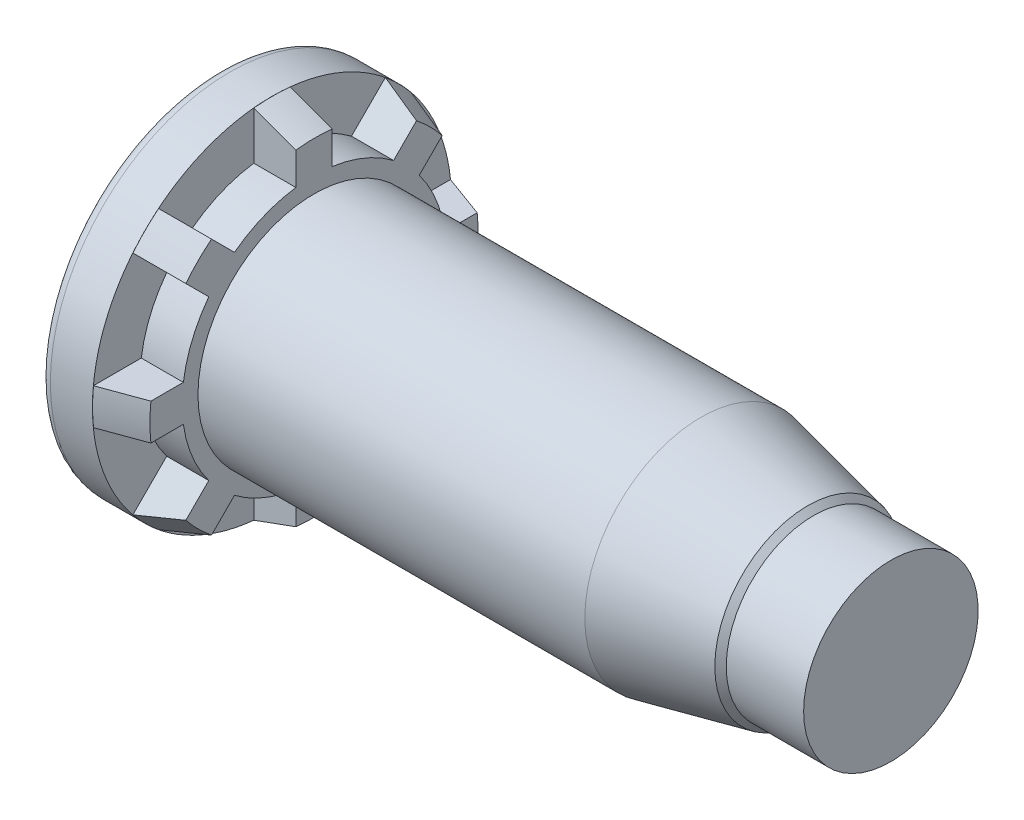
ISO-10303-21;
HEADER;
FILE_DESCRIPTION(('STEP AP214'),'2;1');
FILE_NAME('part.step','',(''),(''),'','','');
FILE_SCHEMA(('AUTOMOTIVE_DESIGN { 1 0 10303 214 1 1 1 1 }'));
ENDSEC;
DATA;
#1=APPLICATION_CONTEXT('core data for automotive mechanical design processes');
#2=APPLICATION_PROTOCOL_DEFINITION('international standard','automotive_design',2000,#1);
#3=PRODUCT_CONTEXT('',#1,'mechanical');
#4=PRODUCT('Part','Part','',(#3));
#5=PRODUCT_RELATED_PRODUCT_CATEGORY('part','',(#4));
#6=PRODUCT_DEFINITION_FORMATION('','',#4);
#7=PRODUCT_DEFINITION_CONTEXT('part definition',#1,'design');
#8=PRODUCT_DEFINITION('design','',#6,#7);
#9=PRODUCT_DEFINITION_SHAPE('','',#8);
#10=(LENGTH_UNIT() NAMED_UNIT(*) SI_UNIT(.MILLI.,.METRE.));
#11=(NAMED_UNIT(*) PLANE_ANGLE_UNIT() SI_UNIT($,.RADIAN.));
#12=(NAMED_UNIT(*) SI_UNIT($,.STERADIAN.) SOLID_ANGLE_UNIT());
#13=UNCERTAINTY_MEASURE_WITH_UNIT(LENGTH_MEASURE(1.E-05),#10,'distance_accuracy_value','');
#14=(GEOMETRIC_REPRESENTATION_CONTEXT(3) GLOBAL_UNCERTAINTY_ASSIGNED_CONTEXT((#13)) GLOBAL_UNIT_ASSIGNED_CONTEXT((#10,
#11,#12)) REPRESENTATION_CONTEXT('',''));
#15=CARTESIAN_POINT('',(0.,0.,0.));
#16=DIRECTION('',(0.,0.,1.));
#17=DIRECTION('',(1.,0.,0.));
#18=AXIS2_PLACEMENT_3D('',#15,#16,#17);
#19=CARTESIAN_POINT('',(0.00254,0.,0.));
#20=DIRECTION('',(-1.,0.,0.));
#21=DIRECTION('',(0.,0.,1.));
#22=AXIS2_PLACEMENT_3D('',#19,#20,#21);
#23=CONICAL_SURFACE('',#22,7.36346,0.349065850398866);
#24=CARTESIAN_POINT('',(1.72739999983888,4.20680011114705,5.26041628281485));
#25=CARTESIAN_POINT('',(1.43990711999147,4.28124598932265,5.33486216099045));
#26=CARTESIAN_POINT('',(1.15240568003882,4.35567533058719,5.40929150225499));
#27=CARTESIAN_POINT('',(0.577385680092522,4.5045009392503,5.55811711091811));
#28=CARTESIAN_POINT('',(0.28986712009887,4.57889720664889,5.6325133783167));
#29=CARTESIAN_POINT('',(0.00233999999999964,4.65327693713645,5.70689310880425));
#30=B_SPLINE_CURVE_WITH_KNOTS('',3,(#24,#25,#26,#27,#28,#29),.UNSPECIFIED.,.F.,.F.,(4,2,4),(0.,
0.918492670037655,1.83698533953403),.UNSPECIFIED.);
#31=CARTESIAN_POINT('',(1.72719999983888,4.20685190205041,5.26046807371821));
#32=VERTEX_POINT('',#31);
#33=CARTESIAN_POINT('',(0.00254,4.65322519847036,5.70684137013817));
#34=VERTEX_POINT('',#33);
#35=EDGE_CURVE('E551',#32,#34,#30,.T.);
#36=ORIENTED_EDGE('',*,*,#35,.F.);
#37=CARTESIAN_POINT('',(1.7272,0.,0.));
#38=DIRECTION('',(-1.,0.,0.));
#39=DIRECTION('',(0.,0.,1.));
#40=AXIS2_PLACEMENT_3D('',#37,#38,#39);
#41=CIRCLE('',#40,6.73573509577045);
#42=CARTESIAN_POINT('',(1.72719999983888,5.2604680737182,4.20685190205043));
#43=VERTEX_POINT('',#42);
#44=EDGE_CURVE('E554',#32,#43,#41,.T.);
#45=ORIENTED_EDGE('',*,*,#44,.T.);
#46=CARTESIAN_POINT('',(0.00234000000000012,5.70689310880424,4.65327693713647));
#47=CARTESIAN_POINT('',(0.28986712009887,5.63251337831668,4.57889720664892));
#48=CARTESIAN_POINT('',(0.577385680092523,5.55811711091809,4.50450093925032));
#49=CARTESIAN_POINT('',(1.15240568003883,5.40929150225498,4.35567533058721));
#50=CARTESIAN_POINT('',(1.43990711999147,5.33486216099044,4.28124598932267));
#51=CARTESIAN_POINT('',(1.72739999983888,5.26041628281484,4.20680011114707));
#52=B_SPLINE_CURVE_WITH_KNOTS('',3,(#46,#47,#48,#49,#50,#51),.UNSPECIFIED.,.F.,.F.,(4,2,4),(0.,
0.918492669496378,1.83698533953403),.UNSPECIFIED.);
#53=CARTESIAN_POINT('',(0.00254,5.70684137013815,4.65322519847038));
#54=VERTEX_POINT('',#53);
#55=EDGE_CURVE('E449',#54,#43,#52,.T.);
#56=ORIENTED_EDGE('',*,*,#55,.F.);
#57=CARTESIAN_POINT('',(0.00254,0.,0.));
#58=DIRECTION('',(-1.,0.,0.));
#59=DIRECTION('',(0.,0.,1.));
#60=AXIS2_PLACEMENT_3D('',#57,#58,#59);
#61=CIRCLE('',#60,7.36346);
#62=EDGE_CURVE('E556',#34,#54,#61,.T.);
#63=ORIENTED_EDGE('',*,*,#62,.F.);
#64=EDGE_LOOP('',(#36,#45,#56,#63));
#65=FACE_BOUND('',#64,.T.);
#66=ADVANCED_FACE('F32',(#65),#23,.T.);
#67=CARTESIAN_POINT('',(1.72739999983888,-5.26041628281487,4.20680011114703));
#68=CARTESIAN_POINT('',(1.43990711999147,-5.33486216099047,4.28124598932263));
#69=CARTESIAN_POINT('',(1.15240568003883,-5.40929150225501,4.35567533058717));
#70=CARTESIAN_POINT('',(0.577385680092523,-5.55811711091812,4.50450093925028));
#71=CARTESIAN_POINT('',(0.28986712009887,-5.63251337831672,4.57889720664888));
#72=CARTESIAN_POINT('',(0.00234000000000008,-5.70689310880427,4.65327693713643));
#73=B_SPLINE_CURVE_WITH_KNOTS('',3,(#67,#68,#69,#70,#71,#72),.UNSPECIFIED.,.F.,.F.,(4,2,4),(0.,
0.918492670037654,1.83698533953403),.UNSPECIFIED.);
#74=CARTESIAN_POINT('',(1.72719999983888,-5.26046807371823,4.20685190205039));
#75=VERTEX_POINT('',#74);
#76=CARTESIAN_POINT('',(0.00254,-5.70684137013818,4.65322519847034));
#77=VERTEX_POINT('',#76);
#78=EDGE_CURVE('E604',#75,#77,#73,.T.);
#79=ORIENTED_EDGE('',*,*,#78,.F.);
#80=CARTESIAN_POINT('',(1.72719999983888,-4.20685190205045,5.26046807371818));
#81=VERTEX_POINT('',#80);
#82=EDGE_CURVE('E568',#75,#81,#41,.T.);
#83=ORIENTED_EDGE('',*,*,#82,.T.);
#84=CARTESIAN_POINT('',(0.00234000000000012,-4.65327693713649,5.70689310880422));
#85=CARTESIAN_POINT('',(0.28986712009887,-4.57889720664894,5.63251337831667));
#86=CARTESIAN_POINT('',(0.577385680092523,-4.50450093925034,5.55811711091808));
#87=CARTESIAN_POINT('',(1.15240568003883,-4.35567533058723,5.40929150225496));
#88=CARTESIAN_POINT('',(1.43990711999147,-4.28124598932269,5.33486216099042));
#89=CARTESIAN_POINT('',(1.72739999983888,-4.20680011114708,5.26041628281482));
#90=B_SPLINE_CURVE_WITH_KNOTS('',3,(#84,#85,#86,#87,#88,#89),.UNSPECIFIED.,.F.,.F.,(4,2,4),(0.,
0.918492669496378,1.83698533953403),.UNSPECIFIED.);
#91=CARTESIAN_POINT('',(0.00254,-4.6532251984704,5.70684137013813));
#92=VERTEX_POINT('',#91);
#93=EDGE_CURVE('E602',#92,#81,#90,.T.);
#94=ORIENTED_EDGE('',*,*,#93,.F.);
#95=EDGE_CURVE('E751',#77,#92,#61,.T.);
#96=ORIENTED_EDGE('',*,*,#95,.F.);
#97=EDGE_LOOP('',(#79,#83,#94,#96));
#98=FACE_BOUND('',#97,.T.);
#99=ADVANCED_FACE('F542',(#98),#23,.T.);
#100=CARTESIAN_POINT('',(-4.27246553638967,0.74501913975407,8.88826546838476));
#101=CARTESIAN_POINT('',(-3.51512222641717,0.745019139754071,8.61164424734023));
#102=CARTESIAN_POINT('',(-2.75780524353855,0.745019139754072,8.33495090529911));
#103=CARTESIAN_POINT('',(-1.24325020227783,0.745019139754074,7.78134871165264));
#104=CARTESIAN_POINT('',(-0.4860121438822,0.745019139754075,7.50443986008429));
#105=CARTESIAN_POINT('',(1.02835911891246,0.745019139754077,6.95033525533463));
#106=CARTESIAN_POINT('',(1.78549232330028,0.745019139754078,6.67313950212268));
#107=CARTESIAN_POINT('',(3.29960004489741,0.74501913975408,6.11831457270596));
#108=CARTESIAN_POINT('',(4.05657456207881,0.745019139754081,5.84068539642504));
#109=CARTESIAN_POINT('',(4.81344272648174,0.745019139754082,5.56276628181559));
#110=B_SPLINE_CURVE_WITH_KNOTS('',3,(#100,#101,#102,#103,#104,#105,#106,#107,#108,#109),
.UNSPECIFIED.,.F.,.F.,(4,2,2,2,4),(0.,2.41884141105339,4.83768240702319,7.25652366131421,
9.67536534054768),.UNSPECIFIED.);
#111=CARTESIAN_POINT('',(0.00254,0.745019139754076,7.32567332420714));
#112=VERTEX_POINT('',#111);
#113=CARTESIAN_POINT('',(1.72719999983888,0.745019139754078,6.69440615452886));
#114=VERTEX_POINT('',#113);
#115=EDGE_CURVE('E559',#112,#114,#110,.T.);
#116=ORIENTED_EDGE('',*,*,#115,.F.);
#117=CARTESIAN_POINT('',(0.00254,-0.745019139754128,7.32567332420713));
#118=VERTEX_POINT('',#117);
#119=EDGE_CURVE('E683',#118,#112,#61,.T.);
#120=ORIENTED_EDGE('',*,*,#119,.F.);
#121=CARTESIAN_POINT('',(4.81344272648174,-0.745019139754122,5.56276628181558));
#122=CARTESIAN_POINT('',(4.05657456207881,-0.745019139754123,5.84068539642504));
#123=CARTESIAN_POINT('',(3.29960004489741,-0.745019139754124,6.11831457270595));
#124=CARTESIAN_POINT('',(1.78549232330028,-0.745019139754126,6.67313950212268));
#125=CARTESIAN_POINT('',(1.02835911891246,-0.745019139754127,6.95033525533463));
#126=CARTESIAN_POINT('',(-0.486012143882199,-0.745019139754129,7.50443986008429));
#127=CARTESIAN_POINT('',(-1.24325020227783,-0.74501913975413,7.78134871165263));
#128=CARTESIAN_POINT('',(-2.75780524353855,-0.745019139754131,8.3349509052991));
#129=CARTESIAN_POINT('',(-3.51512222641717,-0.745019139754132,8.61164424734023));
#130=CARTESIAN_POINT('',(-4.27246553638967,-0.745019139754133,8.88826546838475));
#131=B_SPLINE_CURVE_WITH_KNOTS('',3,(#121,#122,#123,#124,#125,#126,#127,#128,#129,#130),
.UNSPECIFIED.,.F.,.F.,(4,2,2,2,4),(0.,2.41884167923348,4.83768293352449,7.25652392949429,
9.67536534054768),.UNSPECIFIED.);
#132=CARTESIAN_POINT('',(1.72719999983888,-0.745019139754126,6.69440615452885));
#133=VERTEX_POINT('',#132);
#134=EDGE_CURVE('E622',#133,#118,#131,.T.);
#135=ORIENTED_EDGE('',*,*,#134,.F.);
#136=EDGE_CURVE('E563',#133,#114,#41,.T.);
#137=ORIENTED_EDGE('',*,*,#136,.T.);
#138=EDGE_LOOP('',(#116,#120,#135,#137));
#139=FACE_BOUND('',#138,.T.);
#140=ADVANCED_FACE('F547',(#139),#23,.T.);
#141=CARTESIAN_POINT('',(4.81344272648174,0.74501913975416,-5.56276628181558));
#142=CARTESIAN_POINT('',(4.05657456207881,0.745019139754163,-5.84068539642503));
#143=CARTESIAN_POINT('',(3.29960004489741,0.745019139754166,-6.11831457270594));
#144=CARTESIAN_POINT('',(1.78549232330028,0.745019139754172,-6.67313950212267));
#145=CARTESIAN_POINT('',(1.02835911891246,0.745019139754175,-6.95033525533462));
#146=CARTESIAN_POINT('',(-0.486012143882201,0.745019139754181,-7.50443986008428));
#147=CARTESIAN_POINT('',(-1.24325020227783,0.745019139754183,-7.78134871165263));
#148=CARTESIAN_POINT('',(-2.75780524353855,0.745019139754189,-8.3349509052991));
#149=CARTESIAN_POINT('',(-3.51512222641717,0.745019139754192,-8.61164424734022));
#150=CARTESIAN_POINT('',(-4.27246553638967,0.745019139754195,-8.88826546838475));
#151=B_SPLINE_CURVE_WITH_KNOTS('',3,(#141,#142,#143,#144,#145,#146,#147,#148,#149,#150),
.UNSPECIFIED.,.F.,.F.,(4,2,2,2,4),(0.,2.41884167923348,4.83768293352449,7.2565239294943,
9.67536534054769),.UNSPECIFIED.);
#152=CARTESIAN_POINT('',(1.72719999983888,0.745019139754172,-6.69440615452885));
#153=VERTEX_POINT('',#152);
#154=CARTESIAN_POINT('',(0.00254,0.745019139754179,-7.32567332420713));
#155=VERTEX_POINT('',#154);
#156=EDGE_CURVE('E698',#153,#155,#151,.T.);
#157=ORIENTED_EDGE('',*,*,#156,.F.);
#158=CARTESIAN_POINT('',(1.72719999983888,-0.745019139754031,-6.69440615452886));
#159=VERTEX_POINT('',#158);
#160=EDGE_CURVE('E570',#153,#159,#41,.T.);
#161=ORIENTED_EDGE('',*,*,#160,.T.);
#162=CARTESIAN_POINT('',(-4.27246553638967,-0.745019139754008,-8.88826546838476));
#163=CARTESIAN_POINT('',(-3.51512222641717,-0.745019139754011,-8.61164424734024));
#164=CARTESIAN_POINT('',(-2.75780524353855,-0.745019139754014,-8.33495090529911));
#165=CARTESIAN_POINT('',(-1.24325020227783,-0.74501913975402,-7.78134871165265));
#166=CARTESIAN_POINT('',(-0.4860121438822,-0.745019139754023,-7.5044398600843));
#167=CARTESIAN_POINT('',(1.02835911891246,-0.745019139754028,-6.95033525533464));
#168=CARTESIAN_POINT('',(1.78549232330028,-0.745019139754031,-6.67313950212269));
#169=CARTESIAN_POINT('',(3.29960004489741,-0.745019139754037,-6.11831457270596));
#170=CARTESIAN_POINT('',(4.05657456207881,-0.74501913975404,-5.84068539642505));
#171=CARTESIAN_POINT('',(4.81344272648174,-0.745019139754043,-5.56276628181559));
#172=B_SPLINE_CURVE_WITH_KNOTS('',3,(#162,#163,#164,#165,#166,#167,#168,#169,#170,#171),
.UNSPECIFIED.,.F.,.F.,(4,2,2,2,4),(0.,2.41884141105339,4.83768240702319,7.25652366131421,
9.67536534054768),.UNSPECIFIED.);
#173=CARTESIAN_POINT('',(0.00254,-0.745019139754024,-7.32567332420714));
#174=VERTEX_POINT('',#173);
#175=EDGE_CURVE('E702',#174,#159,#172,.T.);
#176=ORIENTED_EDGE('',*,*,#175,.F.);
#177=EDGE_CURVE('E676',#155,#174,#61,.T.);
#178=ORIENTED_EDGE('',*,*,#177,.F.);
#179=EDGE_LOOP('',(#157,#161,#176,#178));
#180=FACE_BOUND('',#179,.T.);
#181=ADVANCED_FACE('F927',(#180),#23,.T.);
#182=CARTESIAN_POINT('',(1.72739999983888,-4.20680011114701,-5.26041628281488));
#183=CARTESIAN_POINT('',(1.43990711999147,-4.28124598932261,-5.33486216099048));
#184=CARTESIAN_POINT('',(1.15240568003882,-4.35567533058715,-5.40929150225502));
#185=CARTESIAN_POINT('',(0.577385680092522,-4.50450093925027,-5.55811711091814));
#186=CARTESIAN_POINT('',(0.28986712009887,-4.57889720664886,-5.63251337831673));
#187=CARTESIAN_POINT('',(0.00233999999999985,-4.65327693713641,-5.70689310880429));
#188=B_SPLINE_CURVE_WITH_KNOTS('',3,(#182,#183,#184,#185,#186,#187),.UNSPECIFIED.,.F.,.F.,(4,2,
4),(0.,0.918492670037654,1.83698533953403),.UNSPECIFIED.);
#189=CARTESIAN_POINT('',(1.72719999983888,-4.20685190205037,-5.26046807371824));
#190=VERTEX_POINT('',#189);
#191=CARTESIAN_POINT('',(0.00254,-4.65322519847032,-5.7068413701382));
#192=VERTEX_POINT('',#191);
#193=EDGE_CURVE('E699',#190,#192,#188,.T.);
#194=ORIENTED_EDGE('',*,*,#193,.F.);
#195=CARTESIAN_POINT('',(1.72719999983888,-5.26046807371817,-4.20685190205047));
#196=VERTEX_POINT('',#195);
#197=EDGE_CURVE('E581',#190,#196,#41,.T.);
#198=ORIENTED_EDGE('',*,*,#197,.T.);
#199=CARTESIAN_POINT('',(0.00234000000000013,-5.7068931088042,-4.65327693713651));
#200=CARTESIAN_POINT('',(0.28986712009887,-5.63251337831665,-4.57889720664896));
#201=CARTESIAN_POINT('',(0.577385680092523,-5.55811711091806,-4.50450093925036));
#202=CARTESIAN_POINT('',(1.15240568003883,-5.40929150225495,-4.35567533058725));
#203=CARTESIAN_POINT('',(1.43990711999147,-5.33486216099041,-4.2812459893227));
#204=CARTESIAN_POINT('',(1.72739999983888,-5.26041628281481,-4.2068001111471));
#205=B_SPLINE_CURVE_WITH_KNOTS('',3,(#199,#200,#201,#202,#203,#204),.UNSPECIFIED.,.F.,.F.,(4,2,
4),(0.,0.918492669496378,1.83698533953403),.UNSPECIFIED.);
#206=CARTESIAN_POINT('',(0.00254,-5.70684137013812,-4.65322519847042));
#207=VERTEX_POINT('',#206);
#208=EDGE_CURVE('E320',#207,#196,#205,.T.);
#209=ORIENTED_EDGE('',*,*,#208,.F.);
#210=EDGE_CURVE('E682',#192,#207,#61,.T.);
#211=ORIENTED_EDGE('',*,*,#210,.F.);
#212=EDGE_LOOP('',(#194,#198,#209,#211));
#213=FACE_BOUND('',#212,.T.);
#214=ADVANCED_FACE('F924',(#213),#23,.T.);
#215=CARTESIAN_POINT('',(-4.27246553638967,-8.88826546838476,0.745019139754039));
#216=CARTESIAN_POINT('',(-3.51512222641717,-8.61164424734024,0.745019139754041));
#217=CARTESIAN_POINT('',(-2.75780524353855,-8.33495090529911,0.745019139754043));
#218=CARTESIAN_POINT('',(-1.24325020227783,-7.78134871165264,0.745019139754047));
#219=CARTESIAN_POINT('',(-0.486012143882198,-7.5044398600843,0.745019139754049));
#220=CARTESIAN_POINT('',(1.02835911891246,-6.95033525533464,0.745019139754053));
#221=CARTESIAN_POINT('',(1.78549232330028,-6.67313950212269,0.745019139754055));
#222=CARTESIAN_POINT('',(3.29960004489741,-6.11831457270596,0.745019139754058));
#223=CARTESIAN_POINT('',(4.05657456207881,-5.84068539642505,0.74501913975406));
#224=CARTESIAN_POINT('',(4.81344272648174,-5.56276628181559,0.745019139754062));
#225=B_SPLINE_CURVE_WITH_KNOTS('',3,(#215,#216,#217,#218,#219,#220,#221,#222,#223,#224),
.UNSPECIFIED.,.F.,.F.,(4,2,2,2,4),(0.,2.41884141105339,4.83768240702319,7.25652366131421,
9.67536534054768),.UNSPECIFIED.);
#226=CARTESIAN_POINT('',(0.00254,-7.32567332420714,0.74501913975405));
#227=VERTEX_POINT('',#226);
#228=CARTESIAN_POINT('',(1.72719999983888,-6.69440615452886,0.745019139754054));
#229=VERTEX_POINT('',#228);
#230=EDGE_CURVE('E750',#227,#229,#225,.T.);
#231=ORIENTED_EDGE('',*,*,#230,.F.);
#232=CARTESIAN_POINT('',(0.00254,-7.32567332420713,-0.745019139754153));
#233=VERTEX_POINT('',#232);
#234=EDGE_CURVE('E744',#233,#227,#61,.T.);
#235=ORIENTED_EDGE('',*,*,#234,.F.);
#236=CARTESIAN_POINT('',(4.81344272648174,-5.56276628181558,-0.745019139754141));
#237=CARTESIAN_POINT('',(4.05657456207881,-5.84068539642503,-0.745019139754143));
#238=CARTESIAN_POINT('',(3.29960004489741,-6.11831457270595,-0.745019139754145));
#239=CARTESIAN_POINT('',(1.78549232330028,-6.67313950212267,-0.745019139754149));
#240=CARTESIAN_POINT('',(1.02835911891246,-6.95033525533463,-0.745019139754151));
#241=CARTESIAN_POINT('',(-0.4860121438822,-7.50443986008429,-0.745019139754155));
#242=CARTESIAN_POINT('',(-1.24325020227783,-7.78134871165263,-0.745019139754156));
#243=CARTESIAN_POINT('',(-2.75780524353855,-8.3349509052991,-0.74501913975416));
#244=CARTESIAN_POINT('',(-3.51512222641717,-8.61164424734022,-0.745019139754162));
#245=CARTESIAN_POINT('',(-4.27246553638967,-8.88826546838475,-0.745019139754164));
#246=B_SPLINE_CURVE_WITH_KNOTS('',3,(#236,#237,#238,#239,#240,#241,#242,#243,#244,#245),
.UNSPECIFIED.,.F.,.F.,(4,2,2,2,4),(0.,2.41884167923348,4.83768293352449,7.2565239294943,
9.67536534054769),.UNSPECIFIED.);
#247=CARTESIAN_POINT('',(1.72719999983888,-6.69440615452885,-0.745019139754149));
#248=VERTEX_POINT('',#247);
#249=EDGE_CURVE('E419',#248,#233,#246,.T.);
#250=ORIENTED_EDGE('',*,*,#249,.F.);
#251=EDGE_CURVE('E587',#248,#229,#41,.T.);
#252=ORIENTED_EDGE('',*,*,#251,.T.);
#253=EDGE_LOOP('',(#231,#235,#250,#252));
#254=FACE_BOUND('',#253,.T.);
#255=ADVANCED_FACE('F749',(#254),#23,.T.);
#256=CARTESIAN_POINT('',(0.,0.,0.));
#257=DIRECTION('',(-1.,0.,0.));
#258=DIRECTION('',(0.,0.,1.));
#259=AXIS2_PLACEMENT_3D('',#256,#257,#258);
#260=CYLINDRICAL_SURFACE('',#259,7.36346);
#261=CARTESIAN_POINT('',(0.,0.,0.));
#262=DIRECTION('',(-1.,0.,0.));
#263=DIRECTION('',(0.,0.,1.));
#264=AXIS2_PLACEMENT_3D('',#261,#262,#263);
#265=CIRCLE('',#264,7.36346);
#266=CARTESIAN_POINT('',(0.,4.65322519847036,5.70684137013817));
#267=VERTEX_POINT('',#266);
#268=CARTESIAN_POINT('',(-1.61121766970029E-10,5.70684137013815,4.65322519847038));
#269=VERTEX_POINT('',#268);
#270=EDGE_CURVE('E631',#267,#269,#265,.T.);
#271=ORIENTED_EDGE('',*,*,#270,.F.);
#272=DIRECTION('',(-1.,0.,0.));
#273=VECTOR('',#272,1.);
#274=CARTESIAN_POINT('',(0.,4.65322519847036,5.70684137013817));
#275=LINE('',#274,#273);
#276=EDGE_CURVE('E11',#267,#34,#275,.F.);
#277=ORIENTED_EDGE('',*,*,#276,.T.);
#278=ORIENTED_EDGE('',*,*,#62,.T.);
#279=DIRECTION('',(-1.,0.,0.));
#280=VECTOR('',#279,1.);
#281=CARTESIAN_POINT('',(0.,5.70684137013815,4.65322519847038));
#282=LINE('',#281,#280);
#283=EDGE_CURVE('E693',#54,#269,#282,.T.);
#284=ORIENTED_EDGE('',*,*,#283,.T.);
#285=EDGE_LOOP('',(#271,#277,#278,#284));
#286=FACE_BOUND('',#285,.T.);
#287=ADVANCED_FACE('F496',(#286),#260,.T.);
#288=CARTESIAN_POINT('',(0.,-5.70684137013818,4.65322519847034));
#289=VERTEX_POINT('',#288);
#290=CARTESIAN_POINT('',(-1.61121766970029E-10,-4.6532251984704,5.70684137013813));
#291=VERTEX_POINT('',#290);
#292=EDGE_CURVE('E630',#289,#291,#265,.T.);
#293=ORIENTED_EDGE('',*,*,#292,.F.);
#294=DIRECTION('',(-1.,0.,0.));
#295=VECTOR('',#294,1.);
#296=CARTESIAN_POINT('',(0.,-5.70684137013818,4.65322519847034));
#297=LINE('',#296,#295);
#298=EDGE_CURVE('E854',#289,#77,#297,.F.);
#299=ORIENTED_EDGE('',*,*,#298,.T.);
#300=ORIENTED_EDGE('',*,*,#95,.T.);
#301=DIRECTION('',(-1.,0.,0.));
#302=VECTOR('',#301,1.);
#303=CARTESIAN_POINT('',(0.,-4.6532251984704,5.70684137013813));
#304=LINE('',#303,#302);
#305=EDGE_CURVE('E627',#92,#291,#304,.T.);
#306=ORIENTED_EDGE('',*,*,#305,.T.);
#307=EDGE_LOOP('',(#293,#299,#300,#306));
#308=FACE_BOUND('',#307,.T.);
#309=ADVANCED_FACE('F857',(#308),#260,.T.);
#310=ORIENTED_EDGE('',*,*,#119,.T.);
#311=DIRECTION('',(-1.,0.,0.));
#312=VECTOR('',#311,1.);
#313=CARTESIAN_POINT('',(0.,0.745019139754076,7.32567332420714));
#314=LINE('',#313,#312);
#315=CARTESIAN_POINT('',(-1.61121766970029E-10,0.745019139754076,7.32567332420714));
#316=VERTEX_POINT('',#315);
#317=EDGE_CURVE('E41',#112,#316,#314,.T.);
#318=ORIENTED_EDGE('',*,*,#317,.T.);
#319=CARTESIAN_POINT('',(0.,-0.745019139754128,7.32567332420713));
#320=VERTEX_POINT('',#319);
#321=EDGE_CURVE('E296',#320,#316,#265,.T.);
#322=ORIENTED_EDGE('',*,*,#321,.F.);
#323=DIRECTION('',(-1.,0.,0.));
#324=VECTOR('',#323,1.);
#325=CARTESIAN_POINT('',(0.,-0.745019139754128,7.32567332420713));
#326=LINE('',#325,#324);
#327=EDGE_CURVE('E620',#320,#118,#326,.F.);
#328=ORIENTED_EDGE('',*,*,#327,.T.);
#329=EDGE_LOOP('',(#310,#318,#322,#328));
#330=FACE_BOUND('',#329,.T.);
#331=ADVANCED_FACE('F629',(#330),#260,.T.);
#332=CARTESIAN_POINT('',(0.,0.745019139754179,-7.32567332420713));
#333=VERTEX_POINT('',#332);
#334=CARTESIAN_POINT('',(-1.61121766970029E-10,-0.745019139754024,-7.32567332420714));
#335=VERTEX_POINT('',#334);
#336=EDGE_CURVE('E639',#333,#335,#265,.T.);
#337=ORIENTED_EDGE('',*,*,#336,.F.);
#338=DIRECTION('',(-1.,0.,0.));
#339=VECTOR('',#338,1.);
#340=CARTESIAN_POINT('',(0.,0.745019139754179,-7.32567332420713));
#341=LINE('',#340,#339);
#342=EDGE_CURVE('E858',#333,#155,#341,.F.);
#343=ORIENTED_EDGE('',*,*,#342,.T.);
#344=ORIENTED_EDGE('',*,*,#177,.T.);
#345=DIRECTION('',(-1.,0.,0.));
#346=VECTOR('',#345,1.);
#347=CARTESIAN_POINT('',(0.,-0.745019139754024,-7.32567332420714));
#348=LINE('',#347,#346);
#349=EDGE_CURVE('E746',#174,#335,#348,.T.);
#350=ORIENTED_EDGE('',*,*,#349,.T.);
#351=EDGE_LOOP('',(#337,#343,#344,#350));
#352=FACE_BOUND('',#351,.T.);
#353=ADVANCED_FACE('F836',(#352),#260,.T.);
#354=CARTESIAN_POINT('',(0.,-4.65322519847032,-5.7068413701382));
#355=VERTEX_POINT('',#354);
#356=CARTESIAN_POINT('',(-1.61121766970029E-10,-5.70684137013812,-4.65322519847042));
#357=VERTEX_POINT('',#356);
#358=EDGE_CURVE('E842',#355,#357,#265,.T.);
#359=ORIENTED_EDGE('',*,*,#358,.F.);
#360=DIRECTION('',(-1.,0.,0.));
#361=VECTOR('',#360,1.);
#362=CARTESIAN_POINT('',(0.,-4.65322519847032,-5.7068413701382));
#363=LINE('',#362,#361);
#364=EDGE_CURVE('E838',#355,#192,#363,.F.);
#365=ORIENTED_EDGE('',*,*,#364,.T.);
#366=ORIENTED_EDGE('',*,*,#210,.T.);
#367=DIRECTION('',(-1.,0.,0.));
#368=VECTOR('',#367,1.);
#369=CARTESIAN_POINT('',(0.,-5.70684137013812,-4.65322519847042));
#370=LINE('',#369,#368);
#371=EDGE_CURVE('E747',#207,#357,#370,.T.);
#372=ORIENTED_EDGE('',*,*,#371,.T.);
#373=EDGE_LOOP('',(#359,#365,#366,#372));
#374=FACE_BOUND('',#373,.T.);
#375=ADVANCED_FACE('F914',(#374),#260,.T.);
#376=ORIENTED_EDGE('',*,*,#234,.T.);
#377=DIRECTION('',(-1.,0.,0.));
#378=VECTOR('',#377,1.);
#379=CARTESIAN_POINT('',(0.,-7.32567332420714,0.74501913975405));
#380=LINE('',#379,#378);
#381=CARTESIAN_POINT('',(-1.61121766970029E-10,-7.32567332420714,0.74501913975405));
#382=VERTEX_POINT('',#381);
#383=EDGE_CURVE('E626',#227,#382,#380,.T.);
#384=ORIENTED_EDGE('',*,*,#383,.T.);
#385=CARTESIAN_POINT('',(0.,-7.32567332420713,-0.745019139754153));
#386=VERTEX_POINT('',#385);
#387=EDGE_CURVE('E633',#386,#382,#265,.T.);
#388=ORIENTED_EDGE('',*,*,#387,.F.);
#389=DIRECTION('',(-1.,0.,0.));
#390=VECTOR('',#389,1.);
#391=CARTESIAN_POINT('',(0.,-7.32567332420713,-0.745019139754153));
#392=LINE('',#391,#390);
#393=EDGE_CURVE('E736',#386,#233,#392,.F.);
#394=ORIENTED_EDGE('',*,*,#393,.T.);
#395=EDGE_LOOP('',(#376,#384,#388,#394));
#396=FACE_BOUND('',#395,.T.);
#397=ADVANCED_FACE('F742',(#396),#260,.T.);
#398=CARTESIAN_POINT('',(4.81344272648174,5.56276628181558,0.745019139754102));
#399=CARTESIAN_POINT('',(4.05657456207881,5.84068539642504,0.745019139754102));
#400=CARTESIAN_POINT('',(3.29960004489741,6.11831457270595,0.745019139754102));
#401=CARTESIAN_POINT('',(1.78549232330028,6.67313950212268,0.745019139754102));
#402=CARTESIAN_POINT('',(1.02835911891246,6.95033525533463,0.745019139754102));
#403=CARTESIAN_POINT('',(-0.4860121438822,7.50443986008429,0.745019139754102));
#404=CARTESIAN_POINT('',(-1.24325020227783,7.78134871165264,0.745019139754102));
#405=CARTESIAN_POINT('',(-2.75780524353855,8.3349509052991,0.745019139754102));
#406=CARTESIAN_POINT('',(-3.51512222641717,8.61164424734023,0.745019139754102));
#407=CARTESIAN_POINT('',(-4.27246553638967,8.88826546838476,0.745019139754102));
#408=B_SPLINE_CURVE_WITH_KNOTS('',3,(#398,#399,#400,#401,#402,#403,#404,#405,#406,#407),
.UNSPECIFIED.,.F.,.F.,(4,2,2,2,4),(0.,2.41884167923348,4.83768293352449,7.25652392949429,
9.67536534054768),.UNSPECIFIED.);
#409=CARTESIAN_POINT('',(1.72719999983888,6.69440615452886,0.745019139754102));
#410=VERTEX_POINT('',#409);
#411=CARTESIAN_POINT('',(0.00254,7.32567332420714,0.745019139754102));
#412=VERTEX_POINT('',#411);
#413=EDGE_CURVE('E442',#410,#412,#408,.T.);
#414=ORIENTED_EDGE('',*,*,#413,.F.);
#415=CARTESIAN_POINT('',(1.72719999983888,6.69440615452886,-0.745019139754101));
#416=VERTEX_POINT('',#415);
#417=EDGE_CURVE('E564',#410,#416,#41,.T.);
#418=ORIENTED_EDGE('',*,*,#417,.T.);
#419=CARTESIAN_POINT('',(-4.27246553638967,8.88826546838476,-0.745019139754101));
#420=CARTESIAN_POINT('',(-3.51512222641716,8.61164424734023,-0.745019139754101));
#421=CARTESIAN_POINT('',(-2.75780524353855,8.3349509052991,-0.745019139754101));
#422=CARTESIAN_POINT('',(-1.24325020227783,7.78134871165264,-0.745019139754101));
#423=CARTESIAN_POINT('',(-0.486012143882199,7.50443986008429,-0.745019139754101));
#424=CARTESIAN_POINT('',(1.02835911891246,6.95033525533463,-0.745019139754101));
#425=CARTESIAN_POINT('',(1.78549232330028,6.67313950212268,-0.745019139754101));
#426=CARTESIAN_POINT('',(3.29960004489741,6.11831457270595,-0.745019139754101));
#427=CARTESIAN_POINT('',(4.05657456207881,5.84068539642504,-0.745019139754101));
#428=CARTESIAN_POINT('',(4.81344272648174,5.56276628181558,-0.745019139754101));
#429=B_SPLINE_CURVE_WITH_KNOTS('',3,(#419,#420,#421,#422,#423,#424,#425,#426,#427,#428),
.UNSPECIFIED.,.F.,.F.,(4,2,2,2,4),(0.,2.41884141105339,4.83768240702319,7.2565236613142,
9.67536534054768),.UNSPECIFIED.);
#430=CARTESIAN_POINT('',(0.00254,7.32567332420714,-0.745019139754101));
#431=VERTEX_POINT('',#430);
#432=EDGE_CURVE('E470',#431,#416,#429,.T.);
#433=ORIENTED_EDGE('',*,*,#432,.F.);
#434=EDGE_CURVE('E677',#412,#431,#61,.T.);
#435=ORIENTED_EDGE('',*,*,#434,.F.);
#436=EDGE_LOOP('',(#414,#418,#433,#435));
#437=FACE_BOUND('',#436,.T.);
#438=ADVANCED_FACE('F538',(#437),#23,.T.);
#439=CARTESIAN_POINT('',(0.,7.32567332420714,0.745019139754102));
#440=VERTEX_POINT('',#439);
#441=CARTESIAN_POINT('',(-1.61121766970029E-10,7.32567332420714,-0.745019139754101));
#442=VERTEX_POINT('',#441);
#443=EDGE_CURVE('E634',#440,#442,#265,.T.);
#444=ORIENTED_EDGE('',*,*,#443,.F.);
#445=DIRECTION('',(-1.,0.,0.));
#446=VECTOR('',#445,1.);
#447=CARTESIAN_POINT('',(0.,7.32567332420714,0.745019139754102));
#448=LINE('',#447,#446);
#449=EDGE_CURVE('E869',#440,#412,#448,.F.);
#450=ORIENTED_EDGE('',*,*,#449,.T.);
#451=ORIENTED_EDGE('',*,*,#434,.T.);
#452=DIRECTION('',(-1.,0.,0.));
#453=VECTOR('',#452,1.);
#454=CARTESIAN_POINT('',(0.,7.32567332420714,-0.745019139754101));
#455=LINE('',#454,#453);
#456=EDGE_CURVE('E574',#431,#442,#455,.T.);
#457=ORIENTED_EDGE('',*,*,#456,.T.);
#458=EDGE_LOOP('',(#444,#450,#451,#457));
#459=FACE_BOUND('',#458,.T.);
#460=ADVANCED_FACE('F497',(#459),#260,.T.);
#461=CARTESIAN_POINT('',(0.00233999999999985,4.65327693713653,-5.70689310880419));
#462=CARTESIAN_POINT('',(0.28986712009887,4.57889720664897,-5.63251337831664));
#463=CARTESIAN_POINT('',(0.577385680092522,4.50450093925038,-5.55811711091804));
#464=CARTESIAN_POINT('',(1.15240568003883,4.35567533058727,-5.40929150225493));
#465=CARTESIAN_POINT('',(1.43990711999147,4.28124598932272,-5.33486216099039));
#466=CARTESIAN_POINT('',(1.72739999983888,4.20680011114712,-5.26041628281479));
#467=B_SPLINE_CURVE_WITH_KNOTS('',3,(#461,#462,#463,#464,#465,#466),.UNSPECIFIED.,.F.,.F.,(4,2,
4),(0.,0.918492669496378,1.83698533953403),.UNSPECIFIED.);
#468=CARTESIAN_POINT('',(0.00254,4.65322519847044,-5.7068413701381));
#469=VERTEX_POINT('',#468);
#470=CARTESIAN_POINT('',(1.72719999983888,4.20685190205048,-5.26046807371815));
#471=VERTEX_POINT('',#470);
#472=EDGE_CURVE('E695',#469,#471,#467,.T.);
#473=ORIENTED_EDGE('',*,*,#472,.F.);
#474=CARTESIAN_POINT('',(0.00254,5.70684137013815,-4.65322519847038));
#475=VERTEX_POINT('',#474);
#476=EDGE_CURVE('E640',#475,#469,#61,.T.);
#477=ORIENTED_EDGE('',*,*,#476,.F.);
#478=CARTESIAN_POINT('',(1.72739999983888,5.26041628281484,-4.20680011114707));
#479=CARTESIAN_POINT('',(1.43990711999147,5.33486216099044,-4.28124598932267));
#480=CARTESIAN_POINT('',(1.15240568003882,5.40929150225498,-4.35567533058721));
#481=CARTESIAN_POINT('',(0.577385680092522,5.55811711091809,-4.50450093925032));
#482=CARTESIAN_POINT('',(0.289867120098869,5.63251337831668,-4.57889720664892));
#483=CARTESIAN_POINT('',(0.00233999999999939,5.70689310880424,-4.65327693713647));
#484=B_SPLINE_CURVE_WITH_KNOTS('',3,(#478,#479,#480,#481,#482,#483),.UNSPECIFIED.,.F.,.F.,(4,2,
4),(0.,0.918492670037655,1.83698533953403),.UNSPECIFIED.);
#485=CARTESIAN_POINT('',(1.72719999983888,5.2604680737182,-4.20685190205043));
#486=VERTEX_POINT('',#485);
#487=EDGE_CURVE('E479',#486,#475,#484,.T.);
#488=ORIENTED_EDGE('',*,*,#487,.F.);
#489=EDGE_CURVE('E566',#486,#471,#41,.T.);
#490=ORIENTED_EDGE('',*,*,#489,.T.);
#491=EDGE_LOOP('',(#473,#477,#488,#490));
#492=FACE_BOUND('',#491,.T.);
#493=ADVANCED_FACE('F34',(#492),#23,.T.);
#494=CARTESIAN_POINT('',(1.7272,6.73573509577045,0.));
#495=DIRECTION('',(1.,0.,0.));
#496=DIRECTION('',(0.,0.,-1.));
#497=AXIS2_PLACEMENT_3D('',#494,#495,#496);
#498=PLANE('',#497);
#499=DIRECTION('',(0.,0.707106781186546,0.707106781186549));
#500=VECTOR('',#499,1.);
#501=CARTESIAN_POINT('',(1.72719999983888,3.26460163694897,4.31821780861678));
#502=LINE('',#501,#500);
#503=CARTESIAN_POINT('',(1.72719999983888,3.26460163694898,4.31821780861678));
#504=VERTEX_POINT('',#503);
#505=EDGE_CURVE('E299',#504,#32,#502,.T.);
#506=ORIENTED_EDGE('',*,*,#505,.F.);
#507=CARTESIAN_POINT('',(1.72719999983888,0.,0.));
#508=DIRECTION('',(-1.,0.,0.));
#509=DIRECTION('',(0.,1.,0.));
#510=AXIS2_PLACEMENT_3D('',#507,#508,#509);
#511=CIRCLE('',#510,5.413375);
#512=CARTESIAN_POINT('',(1.72719999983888,0.745019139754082,5.36186305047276));
#513=VERTEX_POINT('',#512);
#514=EDGE_CURVE('E316',#513,#504,#511,.T.);
#515=ORIENTED_EDGE('',*,*,#514,.F.);
#516=DIRECTION('',(0.,0.,-1.));
#517=VECTOR('',#516,1.);
#518=CARTESIAN_POINT('',(1.72719999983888,0.745019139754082,5.36186305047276));
#519=LINE('',#518,#517);
#520=EDGE_CURVE('E305',#114,#513,#519,.T.);
#521=ORIENTED_EDGE('',*,*,#520,.F.);
#522=ORIENTED_EDGE('',*,*,#136,.F.);
#523=DIRECTION('',(0.,0.,1.));
#524=VECTOR('',#523,1.);
#525=CARTESIAN_POINT('',(1.72719999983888,-0.745019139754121,5.36186305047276));
#526=LINE('',#525,#524);
#527=CARTESIAN_POINT('',(1.72719999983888,-0.745019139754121,5.36186305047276));
#528=VERTEX_POINT('',#527);
#529=EDGE_CURVE('E346',#528,#133,#526,.T.);
#530=ORIENTED_EDGE('',*,*,#529,.F.);
#531=CARTESIAN_POINT('',(1.72719999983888,0.,0.));
#532=DIRECTION('',(-1.,0.,0.));
#533=DIRECTION('',(0.,0.707106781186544,0.707106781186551));
#534=AXIS2_PLACEMENT_3D('',#531,#532,#533);
#535=CIRCLE('',#534,5.413375);
#536=CARTESIAN_POINT('',(1.72719999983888,-3.26460163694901,4.31821780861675));
#537=VERTEX_POINT('',#536);
#538=EDGE_CURVE('E351',#537,#528,#535,.T.);
#539=ORIENTED_EDGE('',*,*,#538,.F.);
#540=DIRECTION('',(0.,0.707106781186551,-0.707106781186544));
#541=VECTOR('',#540,1.);
#542=CARTESIAN_POINT('',(1.72719999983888,-3.26460163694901,4.31821780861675));
#543=LINE('',#542,#541);
#544=EDGE_CURVE('E340',#81,#537,#543,.T.);
#545=ORIENTED_EDGE('',*,*,#544,.F.);
#546=ORIENTED_EDGE('',*,*,#82,.F.);
#547=DIRECTION('',(0.,-0.707106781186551,0.707106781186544));
#548=VECTOR('',#547,1.);
#549=CARTESIAN_POINT('',(1.72719999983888,-4.31821780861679,3.26460163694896));
#550=LINE('',#549,#548);
#551=CARTESIAN_POINT('',(1.72719999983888,-4.31821780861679,3.26460163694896));
#552=VERTEX_POINT('',#551);
#553=EDGE_CURVE('E325',#552,#75,#550,.T.);
#554=ORIENTED_EDGE('',*,*,#553,.F.);
#555=CARTESIAN_POINT('',(1.72719999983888,0.,0.));
#556=DIRECTION('',(-1.,0.,0.));
#557=DIRECTION('',(0.,0.,1.));
#558=AXIS2_PLACEMENT_3D('',#555,#556,#557);
#559=CIRCLE('',#558,5.413375);
#560=CARTESIAN_POINT('',(1.72719999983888,-5.36186305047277,0.745019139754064));
#561=VERTEX_POINT('',#560);
#562=EDGE_CURVE('E333',#561,#552,#559,.T.);
#563=ORIENTED_EDGE('',*,*,#562,.F.);
#564=DIRECTION('',(0.,1.,0.));
#565=VECTOR('',#564,1.);
#566=CARTESIAN_POINT('',(1.72719999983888,-5.36186305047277,0.745019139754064));
#567=LINE('',#566,#565);
#568=EDGE_CURVE('E331',#229,#561,#567,.T.);
#569=ORIENTED_EDGE('',*,*,#568,.F.);
#570=ORIENTED_EDGE('',*,*,#251,.F.);
#571=DIRECTION('',(0.,-1.,0.));
#572=VECTOR('',#571,1.);
#573=CARTESIAN_POINT('',(1.72719999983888,-5.36186305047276,-0.74501913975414));
#574=LINE('',#573,#572);
#575=CARTESIAN_POINT('',(1.72719999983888,-5.36186305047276,-0.74501913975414));
#576=VERTEX_POINT('',#575);
#577=EDGE_CURVE('E400',#576,#248,#574,.T.);
#578=ORIENTED_EDGE('',*,*,#577,.F.);
#579=CARTESIAN_POINT('',(1.72719999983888,0.,0.));
#580=DIRECTION('',(-1.,0.,0.));
#581=DIRECTION('',(0.,-0.707106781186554,0.707106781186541));
#582=AXIS2_PLACEMENT_3D('',#579,#580,#581);
#583=CIRCLE('',#582,5.413375);
#584=CARTESIAN_POINT('',(1.72719999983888,-4.31821780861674,-3.26460163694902));
#585=VERTEX_POINT('',#584);
#586=EDGE_CURVE('E407',#585,#576,#583,.T.);
#587=ORIENTED_EDGE('',*,*,#586,.F.);
#588=DIRECTION('',(0.,0.707106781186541,0.707106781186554));
#589=VECTOR('',#588,1.);
#590=CARTESIAN_POINT('',(1.72719999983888,-4.31821780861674,-3.26460163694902));
#591=LINE('',#590,#589);
#592=EDGE_CURVE('E376',#196,#585,#591,.T.);
#593=ORIENTED_EDGE('',*,*,#592,.F.);
#594=ORIENTED_EDGE('',*,*,#197,.F.);
#595=DIRECTION('',(0.,-0.707106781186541,-0.707106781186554));
#596=VECTOR('',#595,1.);
#597=CARTESIAN_POINT('',(1.72719999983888,-3.26460163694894,-4.3182178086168));
#598=LINE('',#597,#596);
#599=CARTESIAN_POINT('',(1.72719999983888,-3.26460163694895,-4.3182178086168));
#600=VERTEX_POINT('',#599);
#601=EDGE_CURVE('E361',#600,#190,#598,.T.);
#602=ORIENTED_EDGE('',*,*,#601,.F.);
#603=CARTESIAN_POINT('',(1.72719999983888,0.,0.));
#604=DIRECTION('',(-1.,0.,0.));
#605=DIRECTION('',(0.,-1.,0.));
#606=AXIS2_PLACEMENT_3D('',#603,#604,#605);
#607=CIRCLE('',#606,5.413375);
#608=CARTESIAN_POINT('',(1.72719999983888,-0.745019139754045,-5.36186305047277));
#609=VERTEX_POINT('',#608);
#610=EDGE_CURVE('E369',#609,#600,#607,.T.);
#611=ORIENTED_EDGE('',*,*,#610,.F.);
#612=DIRECTION('',(0.,0.,1.));
#613=VECTOR('',#612,1.);
#614=CARTESIAN_POINT('',(1.72719999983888,-0.745019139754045,-5.36186305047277));
#615=LINE('',#614,#613);
#616=EDGE_CURVE('E367',#159,#609,#615,.T.);
#617=ORIENTED_EDGE('',*,*,#616,.F.);
#618=ORIENTED_EDGE('',*,*,#160,.F.);
#619=DIRECTION('',(0.,0.,-1.));
#620=VECTOR('',#619,1.);
#621=CARTESIAN_POINT('',(1.72719999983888,0.745019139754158,-5.36186305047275));
#622=LINE('',#621,#620);
#623=CARTESIAN_POINT('',(1.72719999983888,0.745019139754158,-5.36186305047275));
#624=VERTEX_POINT('',#623);
#625=EDGE_CURVE('E382',#624,#153,#622,.T.);
#626=ORIENTED_EDGE('',*,*,#625,.F.);
#627=CARTESIAN_POINT('',(1.72719999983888,0.,0.));
#628=DIRECTION('',(-1.,0.,0.));
#629=DIRECTION('',(0.,-0.707106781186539,-0.707106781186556));
#630=AXIS2_PLACEMENT_3D('',#627,#628,#629);
#631=CIRCLE('',#630,5.413375);
#632=CARTESIAN_POINT('',(1.72719999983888,3.26460163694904,-4.31821780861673));
#633=VERTEX_POINT('',#632);
#634=EDGE_CURVE('E390',#633,#624,#631,.T.);
#635=ORIENTED_EDGE('',*,*,#634,.F.);
#636=DIRECTION('',(0.,-0.707106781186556,0.707106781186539));
#637=VECTOR('',#636,1.);
#638=CARTESIAN_POINT('',(1.72719999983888,3.26460163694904,-4.31821780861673));
#639=LINE('',#638,#637);
#640=EDGE_CURVE('E388',#471,#633,#639,.T.);
#641=ORIENTED_EDGE('',*,*,#640,.F.);
#642=ORIENTED_EDGE('',*,*,#489,.F.);
#643=DIRECTION('',(0.,0.707106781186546,-0.707106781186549));
#644=VECTOR('',#643,1.);
#645=CARTESIAN_POINT('',(1.72719999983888,4.31821780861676,-3.26460163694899));
#646=LINE('',#645,#644);
#647=CARTESIAN_POINT('',(1.72719999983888,4.31821780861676,-3.26460163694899));
#648=VERTEX_POINT('',#647);
#649=EDGE_CURVE('E457',#648,#486,#646,.T.);
#650=ORIENTED_EDGE('',*,*,#649,.F.);
#651=CARTESIAN_POINT('',(1.72719999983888,0.,0.));
#652=DIRECTION('',(-1.,0.,0.));
#653=DIRECTION('',(0.,0.,-1.));
#654=AXIS2_PLACEMENT_3D('',#651,#652,#653);
#655=CIRCLE('',#654,5.413375);
#656=CARTESIAN_POINT('',(1.72719999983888,5.36186305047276,-0.745019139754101));
#657=VERTEX_POINT('',#656);
#658=EDGE_CURVE('E464',#657,#648,#655,.T.);
#659=ORIENTED_EDGE('',*,*,#658,.F.);
#660=DIRECTION('',(0.,-1.,0.));
#661=VECTOR('',#660,1.);
#662=CARTESIAN_POINT('',(1.72719999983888,5.36186305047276,-0.745019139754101));
#663=LINE('',#662,#661);
#664=EDGE_CURVE('E448',#416,#657,#663,.T.);
#665=ORIENTED_EDGE('',*,*,#664,.F.);
#666=ORIENTED_EDGE('',*,*,#417,.F.);
#667=DIRECTION('',(0.,1.,0.));
#668=VECTOR('',#667,1.);
#669=CARTESIAN_POINT('',(1.72719999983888,5.36186305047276,0.745019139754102));
#670=LINE('',#669,#668);
#671=CARTESIAN_POINT('',(1.72719999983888,5.36186305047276,0.745019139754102));
#672=VERTEX_POINT('',#671);
#673=EDGE_CURVE('E886',#672,#410,#670,.T.);
#674=ORIENTED_EDGE('',*,*,#673,.F.);
#675=CARTESIAN_POINT('',(1.72719999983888,0.,0.));
#676=DIRECTION('',(-1.,0.,0.));
#677=DIRECTION('',(0.,0.707106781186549,-0.707106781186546));
#678=AXIS2_PLACEMENT_3D('',#675,#676,#677);
#679=CIRCLE('',#678,5.413375);
#680=CARTESIAN_POINT('',(1.72719999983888,4.31821780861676,3.26460163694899));
#681=VERTEX_POINT('',#680);
#682=EDGE_CURVE('E888',#681,#672,#679,.T.);
#683=ORIENTED_EDGE('',*,*,#682,.F.);
#684=DIRECTION('',(0.,-0.707106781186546,-0.707106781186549));
#685=VECTOR('',#684,1.);
#686=CARTESIAN_POINT('',(1.72719999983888,4.31821780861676,3.26460163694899));
#687=LINE('',#686,#685);
#688=EDGE_CURVE('E558',#43,#681,#687,.T.);
#689=ORIENTED_EDGE('',*,*,#688,.F.);
#690=ORIENTED_EDGE('',*,*,#44,.F.);
#691=EDGE_LOOP('',(#506,#515,#521,#522,#530,#539,#545,#546,#554,#563,#569,#570,#578,#587,#593,
#594,#602,#611,#617,#618,#626,#635,#641,#642,#650,#659,#665,#666,#674,#683,#689,#690));
#692=FACE_BOUND('',#691,.T.);
#693=CARTESIAN_POINT('',(1.7272,0.,0.));
#694=DIRECTION('',(-1.,0.,0.));
#695=DIRECTION('',(0.,0.,1.));
#696=AXIS2_PLACEMENT_3D('',#693,#694,#695);
#697=CIRCLE('',#696,4.7625);
#698=CARTESIAN_POINT('',(1.7272,0.,4.7625));
#699=VERTEX_POINT('',#698);
#700=EDGE_CURVE('E569',#699,#699,#697,.T.);
#701=ORIENTED_EDGE('',*,*,#700,.T.);
#702=EDGE_LOOP('',(#701));
#703=FACE_BOUND('',#702,.T.);
#704=ADVANCED_FACE('F530',(#692,#703),#498,.T.);
#705=CARTESIAN_POINT('',(0.,0.,0.));
#706=DIRECTION('',(-1.,0.,0.));
#707=DIRECTION('',(0.,0.,1.));
#708=AXIS2_PLACEMENT_3D('',#705,#706,#707);
#709=CYLINDRICAL_SURFACE('',#708,4.7625);
#710=CARTESIAN_POINT('',(17.6022,0.,0.));
#711=DIRECTION('',(-1.,0.,0.));
#712=DIRECTION('',(0.,0.,1.));
#713=AXIS2_PLACEMENT_3D('',#710,#711,#712);
#714=CIRCLE('',#713,4.7625);
#715=CARTESIAN_POINT('',(17.6022,0.,4.7625));
#716=VERTEX_POINT('',#715);
#717=EDGE_CURVE('E658',#716,#716,#714,.T.);
#718=ORIENTED_EDGE('',*,*,#717,.T.);
#719=EDGE_LOOP('',(#718));
#720=FACE_BOUND('',#719,.T.);
#721=ORIENTED_EDGE('',*,*,#700,.F.);
#722=EDGE_LOOP('',(#721));
#723=FACE_BOUND('',#722,.T.);
#724=ADVANCED_FACE('F527',(#720,#723),#709,.T.);
#725=CARTESIAN_POINT('',(17.6022,0.,0.));
#726=DIRECTION('',(-1.,0.,0.));
#727=DIRECTION('',(0.,0.,1.));
#728=AXIS2_PLACEMENT_3D('',#725,#726,#727);
#729=CONICAL_SURFACE('',#728,4.7625,0.212377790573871);
#730=CARTESIAN_POINT('',(21.99005,0.,0.));
#731=DIRECTION('',(-1.,0.,0.));
#732=DIRECTION('',(0.,0.,1.));
#733=AXIS2_PLACEMENT_3D('',#730,#731,#732);
#734=CIRCLE('',#733,3.81635);
#735=CARTESIAN_POINT('',(21.99005,0.,3.81635));
#736=VERTEX_POINT('',#735);
#737=EDGE_CURVE('E655',#736,#736,#734,.T.);
#738=ORIENTED_EDGE('',*,*,#737,.T.);
#739=EDGE_LOOP('',(#738));
#740=FACE_BOUND('',#739,.T.);
#741=ORIENTED_EDGE('',*,*,#717,.F.);
#742=EDGE_LOOP('',(#741));
#743=FACE_BOUND('',#742,.T.);
#744=ADVANCED_FACE('F523',(#740,#743),#729,.T.);
#745=CARTESIAN_POINT('',(22.225,0.,0.));
#746=DIRECTION('',(-1.,0.,0.));
#747=DIRECTION('',(0.,0.,1.));
#748=AXIS2_PLACEMENT_3D('',#745,#746,#747);
#749=CONICAL_SURFACE('',#748,3.5814,0.785398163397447);
#750=ORIENTED_EDGE('',*,*,#737,.F.);
#751=EDGE_LOOP('',(#750));
#752=FACE_BOUND('',#751,.T.);
#753=CARTESIAN_POINT('',(22.225,0.,0.));
#754=DIRECTION('',(-1.,0.,0.));
#755=DIRECTION('',(0.,0.,1.));
#756=AXIS2_PLACEMENT_3D('',#753,#754,#755);
#757=CIRCLE('',#756,3.5814);
#758=CARTESIAN_POINT('',(22.225,0.,3.5814));
#759=VERTEX_POINT('',#758);
#760=EDGE_CURVE('E652',#759,#759,#757,.T.);
#761=ORIENTED_EDGE('',*,*,#760,.T.);
#762=EDGE_LOOP('',(#761));
#763=FACE_BOUND('',#762,.T.);
#764=ADVANCED_FACE('F519',(#752,#763),#749,.T.);
#765=CARTESIAN_POINT('',(0.,0.,0.));
#766=DIRECTION('',(-1.,0.,0.));
#767=DIRECTION('',(0.,0.,1.));
#768=AXIS2_PLACEMENT_3D('',#765,#766,#767);
#769=CYLINDRICAL_SURFACE('',#768,3.5814);
#770=CARTESIAN_POINT('',(25.4,0.,0.));
#771=DIRECTION('',(-1.,0.,0.));
#772=DIRECTION('',(0.,0.,1.));
#773=AXIS2_PLACEMENT_3D('',#770,#771,#772);
#774=CIRCLE('',#773,3.5814);
#775=CARTESIAN_POINT('',(25.4,0.,3.5814));
#776=VERTEX_POINT('',#775);
#777=EDGE_CURVE('E649',#776,#776,#774,.T.);
#778=ORIENTED_EDGE('',*,*,#777,.T.);
#779=EDGE_LOOP('',(#778));
#780=FACE_BOUND('',#779,.T.);
#781=ORIENTED_EDGE('',*,*,#760,.F.);
#782=EDGE_LOOP('',(#781));
#783=FACE_BOUND('',#782,.T.);
#784=ADVANCED_FACE('F515',(#780,#783),#769,.T.);
#785=CARTESIAN_POINT('',(25.4,3.5814,0.));
#786=DIRECTION('',(1.,0.,0.));
#787=DIRECTION('',(0.,0.,-1.));
#788=AXIS2_PLACEMENT_3D('',#785,#786,#787);
#789=PLANE('',#788);
#790=ORIENTED_EDGE('',*,*,#777,.F.);
#791=EDGE_LOOP('',(#790));
#792=FACE_BOUND('',#791,.T.);
#793=ADVANCED_FACE('F511',(#792),#789,.T.);
#794=CARTESIAN_POINT('',(-2.159,6.9342,0.));
#795=DIRECTION('',(1.,0.,0.));
#796=DIRECTION('',(0.,0.,-1.));
#797=AXIS2_PLACEMENT_3D('',#794,#795,#796);
#798=PLANE('',#797);
#799=CARTESIAN_POINT('',(-2.159,0.,0.));
#800=DIRECTION('',(-1.,0.,0.));
#801=DIRECTION('',(0.,0.,1.));
#802=AXIS2_PLACEMENT_3D('',#799,#800,#801);
#803=CIRCLE('',#802,6.9342);
#804=CARTESIAN_POINT('',(-2.159,0.,6.9342));
#805=VERTEX_POINT('',#804);
#806=EDGE_CURVE('E646',#805,#805,#803,.T.);
#807=ORIENTED_EDGE('',*,*,#806,.T.);
#808=EDGE_LOOP('',(#807));
#809=FACE_BOUND('',#808,.T.);
#810=ADVANCED_FACE('F507',(#809),#798,.F.);
#811=CARTESIAN_POINT('',(-1.7272,0.,0.));
#812=DIRECTION('',(-1.,0.,0.));
#813=DIRECTION('',(0.,0.,1.));
#814=AXIS2_PLACEMENT_3D('',#811,#812,#813);
#815=TOROIDAL_SURFACE('',#814,6.9342,0.4318);
#816=CARTESIAN_POINT('',(-1.7272,0.,0.));
#817=DIRECTION('',(-1.,0.,0.));
#818=DIRECTION('',(0.,0.,1.));
#819=AXIS2_PLACEMENT_3D('',#816,#817,#818);
#820=CIRCLE('',#819,7.366);
#821=CARTESIAN_POINT('',(-1.7272,0.,7.366));
#822=VERTEX_POINT('',#821);
#823=EDGE_CURVE('E643',#822,#822,#820,.T.);
#824=ORIENTED_EDGE('',*,*,#823,.T.);
#825=EDGE_LOOP('',(#824));
#826=FACE_BOUND('',#825,.T.);
#827=ORIENTED_EDGE('',*,*,#806,.F.);
#828=EDGE_LOOP('',(#827));
#829=FACE_BOUND('',#828,.T.);
#830=ADVANCED_FACE('F503',(#826,#829),#815,.T.);
#831=CARTESIAN_POINT('',(0.,0.,0.));
#832=DIRECTION('',(-1.,0.,0.));
#833=DIRECTION('',(0.,0.,1.));
#834=AXIS2_PLACEMENT_3D('',#831,#832,#833);
#835=CYLINDRICAL_SURFACE('',#834,7.366);
#836=CARTESIAN_POINT('',(0.,0.,0.));
#837=DIRECTION('',(-1.,0.,0.));
#838=DIRECTION('',(0.,0.,1.));
#839=AXIS2_PLACEMENT_3D('',#836,#837,#838);
#840=CIRCLE('',#839,7.366);
#841=CARTESIAN_POINT('',(0.,0.,7.366));
#842=VERTEX_POINT('',#841);
#843=EDGE_CURVE('E638',#842,#842,#840,.T.);
#844=ORIENTED_EDGE('',*,*,#843,.T.);
#845=EDGE_LOOP('',(#844));
#846=FACE_BOUND('',#845,.T.);
#847=ORIENTED_EDGE('',*,*,#823,.F.);
#848=EDGE_LOOP('',(#847));
#849=FACE_BOUND('',#848,.T.);
#850=ADVANCED_FACE('F500',(#846,#849),#835,.T.);
#851=CARTESIAN_POINT('',(0.,7.36346,0.));
#852=DIRECTION('',(-1.,0.,0.));
#853=DIRECTION('',(0.,0.,1.));
#854=AXIS2_PLACEMENT_3D('',#851,#852,#853);
#855=PLANE('',#854);
#856=DIRECTION('',(0.,0.707106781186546,0.707106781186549));
#857=VECTOR('',#856,1.);
#858=CARTESIAN_POINT('',(-1.61121766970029E-10,3.26460163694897,4.31821780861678));
#859=LINE('',#858,#857);
#860=CARTESIAN_POINT('',(-1.61121766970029E-10,3.26460163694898,4.31821780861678));
#861=VERTEX_POINT('',#860);
#862=EDGE_CURVE('E48',#861,#267,#859,.T.);
#863=ORIENTED_EDGE('',*,*,#862,.T.);
#864=ORIENTED_EDGE('',*,*,#270,.T.);
#865=DIRECTION('',(0.,-0.707106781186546,-0.707106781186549));
#866=VECTOR('',#865,1.);
#867=CARTESIAN_POINT('',(-1.61121766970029E-10,4.31821780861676,3.26460163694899));
#868=LINE('',#867,#866);
#869=CARTESIAN_POINT('',(-1.61121766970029E-10,4.31821780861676,3.26460163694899));
#870=VERTEX_POINT('',#869);
#871=EDGE_CURVE('E877',#269,#870,#868,.T.);
#872=ORIENTED_EDGE('',*,*,#871,.T.);
#873=CARTESIAN_POINT('',(-1.61121766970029E-10,0.,0.));
#874=DIRECTION('',(-1.,0.,0.));
#875=DIRECTION('',(0.,0.707106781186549,-0.707106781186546));
#876=AXIS2_PLACEMENT_3D('',#873,#874,#875);
#877=CIRCLE('',#876,5.413375);
#878=CARTESIAN_POINT('',(-1.61121766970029E-10,5.36186305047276,0.745019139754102));
#879=VERTEX_POINT('',#878);
#880=EDGE_CURVE('E892',#870,#879,#877,.T.);
#881=ORIENTED_EDGE('',*,*,#880,.T.);
#882=DIRECTION('',(0.,1.,0.));
#883=VECTOR('',#882,1.);
#884=CARTESIAN_POINT('',(-1.61121766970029E-10,5.36186305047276,0.745019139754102));
#885=LINE('',#884,#883);
#886=EDGE_CURVE('E884',#879,#440,#885,.T.);
#887=ORIENTED_EDGE('',*,*,#886,.T.);
#888=ORIENTED_EDGE('',*,*,#443,.T.);
#889=DIRECTION('',(0.,-1.,0.));
#890=VECTOR('',#889,1.);
#891=CARTESIAN_POINT('',(-1.61121766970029E-10,5.36186305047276,-0.745019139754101));
#892=LINE('',#891,#890);
#893=CARTESIAN_POINT('',(-1.61121766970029E-10,5.36186305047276,-0.745019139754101));
#894=VERTEX_POINT('',#893);
#895=EDGE_CURVE('E454',#442,#894,#892,.T.);
#896=ORIENTED_EDGE('',*,*,#895,.T.);
#897=CARTESIAN_POINT('',(-1.61121766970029E-10,0.,0.));
#898=DIRECTION('',(-1.,0.,0.));
#899=DIRECTION('',(0.,0.,-1.));
#900=AXIS2_PLACEMENT_3D('',#897,#898,#899);
#901=CIRCLE('',#900,5.413375);
#902=CARTESIAN_POINT('',(-1.61121766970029E-10,4.31821780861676,-3.26460163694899));
#903=VERTEX_POINT('',#902);
#904=EDGE_CURVE('E456',#894,#903,#901,.T.);
#905=ORIENTED_EDGE('',*,*,#904,.T.);
#906=DIRECTION('',(0.,0.707106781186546,-0.707106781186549));
#907=VECTOR('',#906,1.);
#908=CARTESIAN_POINT('',(-1.61121766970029E-10,4.31821780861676,-3.26460163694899));
#909=LINE('',#908,#907);
#910=CARTESIAN_POINT('',(0.,5.70684137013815,-4.65322519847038));
#911=VERTEX_POINT('',#910);
#912=EDGE_CURVE('E460',#903,#911,#909,.T.);
#913=ORIENTED_EDGE('',*,*,#912,.T.);
#914=CARTESIAN_POINT('',(-1.61121766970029E-10,4.65322519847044,-5.7068413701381));
#915=VERTEX_POINT('',#914);
#916=EDGE_CURVE('E635',#911,#915,#265,.T.);
#917=ORIENTED_EDGE('',*,*,#916,.T.);
#918=DIRECTION('',(0.,-0.707106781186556,0.707106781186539));
#919=VECTOR('',#918,1.);
#920=CARTESIAN_POINT('',(-1.61121766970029E-10,3.26460163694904,-4.31821780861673));
#921=LINE('',#920,#919);
#922=CARTESIAN_POINT('',(-1.61121766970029E-10,3.26460163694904,-4.31821780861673));
#923=VERTEX_POINT('',#922);
#924=EDGE_CURVE('E379',#915,#923,#921,.T.);
#925=ORIENTED_EDGE('',*,*,#924,.T.);
#926=CARTESIAN_POINT('',(-1.61121766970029E-10,0.,0.));
#927=DIRECTION('',(-1.,0.,0.));
#928=DIRECTION('',(0.,-0.707106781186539,-0.707106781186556));
#929=AXIS2_PLACEMENT_3D('',#926,#927,#928);
#930=CIRCLE('',#929,5.413375);
#931=CARTESIAN_POINT('',(-1.61121766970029E-10,0.745019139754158,-5.36186305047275));
#932=VERTEX_POINT('',#931);
#933=EDGE_CURVE('E381',#923,#932,#930,.T.);
#934=ORIENTED_EDGE('',*,*,#933,.T.);
#935=DIRECTION('',(0.,0.,-1.));
#936=VECTOR('',#935,1.);
#937=CARTESIAN_POINT('',(-1.61121766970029E-10,0.745019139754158,-5.36186305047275));
#938=LINE('',#937,#936);
#939=EDGE_CURVE('E385',#932,#333,#938,.T.);
#940=ORIENTED_EDGE('',*,*,#939,.T.);
#941=ORIENTED_EDGE('',*,*,#336,.T.);
#942=DIRECTION('',(0.,0.,1.));
#943=VECTOR('',#942,1.);
#944=CARTESIAN_POINT('',(-1.61121766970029E-10,-0.745019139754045,-5.36186305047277));
#945=LINE('',#944,#943);
#946=CARTESIAN_POINT('',(-1.61121766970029E-10,-0.745019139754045,-5.36186305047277));
#947=VERTEX_POINT('',#946);
#948=EDGE_CURVE('E358',#335,#947,#945,.T.);
#949=ORIENTED_EDGE('',*,*,#948,.T.);
#950=CARTESIAN_POINT('',(-1.61121766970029E-10,0.,0.));
#951=DIRECTION('',(-1.,0.,0.));
#952=DIRECTION('',(0.,-1.,0.));
#953=AXIS2_PLACEMENT_3D('',#950,#951,#952);
#954=CIRCLE('',#953,5.413375);
#955=CARTESIAN_POINT('',(-1.61121766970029E-10,-3.26460163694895,-4.3182178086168));
#956=VERTEX_POINT('',#955);
#957=EDGE_CURVE('E360',#947,#956,#954,.T.);
#958=ORIENTED_EDGE('',*,*,#957,.T.);
#959=DIRECTION('',(0.,-0.707106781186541,-0.707106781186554));
#960=VECTOR('',#959,1.);
#961=CARTESIAN_POINT('',(-1.61121766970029E-10,-3.26460163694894,-4.3182178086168));
#962=LINE('',#961,#960);
#963=EDGE_CURVE('E364',#956,#355,#962,.T.);
#964=ORIENTED_EDGE('',*,*,#963,.T.);
#965=ORIENTED_EDGE('',*,*,#358,.T.);
#966=DIRECTION('',(0.,0.707106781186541,0.707106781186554));
#967=VECTOR('',#966,1.);
#968=CARTESIAN_POINT('',(-1.61121766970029E-10,-4.31821780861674,-3.26460163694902));
#969=LINE('',#968,#967);
#970=CARTESIAN_POINT('',(-1.61121766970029E-10,-4.31821780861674,-3.26460163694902));
#971=VERTEX_POINT('',#970);
#972=EDGE_CURVE('E397',#357,#971,#969,.T.);
#973=ORIENTED_EDGE('',*,*,#972,.T.);
#974=CARTESIAN_POINT('',(-1.61121766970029E-10,0.,0.));
#975=DIRECTION('',(-1.,0.,0.));
#976=DIRECTION('',(0.,-0.707106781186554,0.707106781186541));
#977=AXIS2_PLACEMENT_3D('',#974,#975,#976);
#978=CIRCLE('',#977,5.413375);
#979=CARTESIAN_POINT('',(-1.61121766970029E-10,-5.36186305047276,-0.74501913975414));
#980=VERTEX_POINT('',#979);
#981=EDGE_CURVE('E399',#971,#980,#978,.T.);
#982=ORIENTED_EDGE('',*,*,#981,.T.);
#983=DIRECTION('',(0.,-1.,0.));
#984=VECTOR('',#983,1.);
#985=CARTESIAN_POINT('',(-1.61121766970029E-10,-5.36186305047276,-0.74501913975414));
#986=LINE('',#985,#984);
#987=EDGE_CURVE('E403',#980,#386,#986,.T.);
#988=ORIENTED_EDGE('',*,*,#987,.T.);
#989=ORIENTED_EDGE('',*,*,#387,.T.);
#990=DIRECTION('',(0.,1.,0.));
#991=VECTOR('',#990,1.);
#992=CARTESIAN_POINT('',(-1.61121766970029E-10,-5.36186305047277,0.745019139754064));
#993=LINE('',#992,#991);
#994=CARTESIAN_POINT('',(-1.61121766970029E-10,-5.36186305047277,0.745019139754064));
#995=VERTEX_POINT('',#994);
#996=EDGE_CURVE('E322',#382,#995,#993,.T.);
#997=ORIENTED_EDGE('',*,*,#996,.T.);
#998=CARTESIAN_POINT('',(-1.61121766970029E-10,0.,0.));
#999=DIRECTION('',(-1.,0.,0.));
#1000=DIRECTION('',(0.,0.,1.));
#1001=AXIS2_PLACEMENT_3D('',#998,#999,#1000);
#1002=CIRCLE('',#1001,5.413375);
#1003=CARTESIAN_POINT('',(-1.61121766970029E-10,-4.31821780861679,3.26460163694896));
#1004=VERTEX_POINT('',#1003);
#1005=EDGE_CURVE('E324',#995,#1004,#1002,.T.);
#1006=ORIENTED_EDGE('',*,*,#1005,.T.);
#1007=DIRECTION('',(0.,-0.707106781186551,0.707106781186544));
#1008=VECTOR('',#1007,1.);
#1009=CARTESIAN_POINT('',(-1.61121766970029E-10,-4.31821780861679,3.26460163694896));
#1010=LINE('',#1009,#1008);
#1011=EDGE_CURVE('E328',#1004,#289,#1010,.T.);
#1012=ORIENTED_EDGE('',*,*,#1011,.T.);
#1013=ORIENTED_EDGE('',*,*,#292,.T.);
#1014=DIRECTION('',(0.,0.707106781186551,-0.707106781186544));
#1015=VECTOR('',#1014,1.);
#1016=CARTESIAN_POINT('',(-1.61121766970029E-10,-3.26460163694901,4.31821780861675));
#1017=LINE('',#1016,#1015);
#1018=CARTESIAN_POINT('',(-1.61121766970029E-10,-3.26460163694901,4.31821780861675));
#1019=VERTEX_POINT('',#1018);
#1020=EDGE_CURVE('E343',#291,#1019,#1017,.T.);
#1021=ORIENTED_EDGE('',*,*,#1020,.T.);
#1022=CARTESIAN_POINT('',(-1.61121766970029E-10,0.,0.));
#1023=DIRECTION('',(-1.,0.,0.));
#1024=DIRECTION('',(0.,0.707106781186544,0.707106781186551));
#1025=AXIS2_PLACEMENT_3D('',#1022,#1023,#1024);
#1026=CIRCLE('',#1025,5.413375);
#1027=CARTESIAN_POINT('',(-1.61121766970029E-10,-0.745019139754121,5.36186305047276));
#1028=VERTEX_POINT('',#1027);
#1029=EDGE_CURVE('E345',#1019,#1028,#1026,.T.);
#1030=ORIENTED_EDGE('',*,*,#1029,.T.);
#1031=DIRECTION('',(0.,0.,1.));
#1032=VECTOR('',#1031,1.);
#1033=CARTESIAN_POINT('',(-1.61121766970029E-10,-0.745019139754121,5.36186305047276));
#1034=LINE('',#1033,#1032);
#1035=EDGE_CURVE('E55',#1028,#320,#1034,.T.);
#1036=ORIENTED_EDGE('',*,*,#1035,.T.);
#1037=ORIENTED_EDGE('',*,*,#321,.T.);
#1038=DIRECTION('',(0.,0.,-1.));
#1039=VECTOR('',#1038,1.);
#1040=CARTESIAN_POINT('',(-1.61121766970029E-10,0.745019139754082,5.36186305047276));
#1041=LINE('',#1040,#1039);
#1042=CARTESIAN_POINT('',(-1.61121766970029E-10,0.745019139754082,5.36186305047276));
#1043=VERTEX_POINT('',#1042);
#1044=EDGE_CURVE('E289',#316,#1043,#1041,.T.);
#1045=ORIENTED_EDGE('',*,*,#1044,.T.);
#1046=CARTESIAN_POINT('',(-1.61121766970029E-10,0.,0.));
#1047=DIRECTION('',(-1.,0.,0.));
#1048=DIRECTION('',(0.,1.,0.));
#1049=AXIS2_PLACEMENT_3D('',#1046,#1047,#1048);
#1050=CIRCLE('',#1049,5.413375);
#1051=EDGE_CURVE('E294',#1043,#861,#1050,.T.);
#1052=ORIENTED_EDGE('',*,*,#1051,.T.);
#1053=EDGE_LOOP('',(#863,#864,#872,#881,#887,#888,#896,#905,#913,#917,#925,#934,#940,#941,#949,
#958,#964,#965,#973,#982,#988,#989,#997,#1006,#1012,#1013,#1021,#1030,#1036,#1037,#1045,#1052));
#1054=FACE_BOUND('',#1053,.T.);
#1055=ORIENTED_EDGE('',*,*,#843,.F.);
#1056=EDGE_LOOP('',(#1055));
#1057=FACE_BOUND('',#1056,.T.);
#1058=ADVANCED_FACE('F291',(#1054,#1057),#855,.F.);
#1059=ORIENTED_EDGE('',*,*,#476,.T.);
#1060=DIRECTION('',(-1.,0.,0.));
#1061=VECTOR('',#1060,1.);
#1062=CARTESIAN_POINT('',(0.,4.65322519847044,-5.7068413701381));
#1063=LINE('',#1062,#1061);
#1064=EDGE_CURVE('E860',#469,#915,#1063,.T.);
#1065=ORIENTED_EDGE('',*,*,#1064,.T.);
#1066=ORIENTED_EDGE('',*,*,#916,.F.);
#1067=DIRECTION('',(-1.,0.,0.));
#1068=VECTOR('',#1067,1.);
#1069=CARTESIAN_POINT('',(0.,5.70684137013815,-4.65322519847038));
#1070=LINE('',#1069,#1068);
#1071=EDGE_CURVE('E579',#911,#475,#1070,.F.);
#1072=ORIENTED_EDGE('',*,*,#1071,.T.);
#1073=EDGE_LOOP('',(#1059,#1065,#1066,#1072));
#1074=FACE_BOUND('',#1073,.T.);
#1075=ADVANCED_FACE('F491',(#1074),#260,.T.);
#1076=CARTESIAN_POINT('',(-1.61121766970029E-10,4.31821780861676,-3.26460163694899));
#1077=DIRECTION('',(0.,-0.707106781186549,-0.707106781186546));
#1078=DIRECTION('',(0.,0.707106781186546,-0.707106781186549));
#1079=AXIS2_PLACEMENT_3D('',#1076,#1077,#1078);
#1080=PLANE('',#1079);
#1081=ORIENTED_EDGE('',*,*,#487,.T.);
#1082=ORIENTED_EDGE('',*,*,#1071,.F.);
#1083=ORIENTED_EDGE('',*,*,#912,.F.);
#1084=DIRECTION('',(1.,0.,0.));
#1085=VECTOR('',#1084,1.);
#1086=CARTESIAN_POINT('',(-1.61121766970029E-10,4.31821780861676,-3.26460163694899));
#1087=LINE('',#1086,#1085);
#1088=EDGE_CURVE('E468',#903,#648,#1087,.T.);
#1089=ORIENTED_EDGE('',*,*,#1088,.T.);
#1090=ORIENTED_EDGE('',*,*,#649,.T.);
#1091=EDGE_LOOP('',(#1081,#1082,#1083,#1089,#1090));
#1092=FACE_BOUND('',#1091,.T.);
#1093=ADVANCED_FACE('F494',(#1092),#1080,.F.);
#1094=CARTESIAN_POINT('',(-1.61121766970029E-10,0.,0.));
#1095=DIRECTION('',(1.,0.,0.));
#1096=DIRECTION('',(0.,0.,-1.));
#1097=AXIS2_PLACEMENT_3D('',#1094,#1095,#1096);
#1098=CYLINDRICAL_SURFACE('',#1097,5.413375);
#1099=ORIENTED_EDGE('',*,*,#658,.T.);
#1100=ORIENTED_EDGE('',*,*,#1088,.F.);
#1101=ORIENTED_EDGE('',*,*,#904,.F.);
#1102=DIRECTION('',(1.,0.,0.));
#1103=VECTOR('',#1102,1.);
#1104=CARTESIAN_POINT('',(-1.61121766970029E-10,5.36186305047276,-0.745019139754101));
#1105=LINE('',#1104,#1103);
#1106=EDGE_CURVE('E462',#894,#657,#1105,.T.);
#1107=ORIENTED_EDGE('',*,*,#1106,.T.);
#1108=EDGE_LOOP('',(#1099,#1100,#1101,#1107));
#1109=FACE_BOUND('',#1108,.T.);
#1110=ADVANCED_FACE('F489',(#1109),#1098,.T.);
#1111=CARTESIAN_POINT('',(-1.61121766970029E-10,5.36186305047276,-0.745019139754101));
#1112=DIRECTION('',(0.,0.,1.));
#1113=DIRECTION('',(1.,0.,0.));
#1114=AXIS2_PLACEMENT_3D('',#1111,#1112,#1113);
#1115=PLANE('',#1114);
#1116=ORIENTED_EDGE('',*,*,#432,.T.);
#1117=ORIENTED_EDGE('',*,*,#664,.T.);
#1118=ORIENTED_EDGE('',*,*,#1106,.F.);
#1119=ORIENTED_EDGE('',*,*,#895,.F.);
#1120=ORIENTED_EDGE('',*,*,#456,.F.);
#1121=EDGE_LOOP('',(#1116,#1117,#1118,#1119,#1120));
#1122=FACE_BOUND('',#1121,.T.);
#1123=ADVANCED_FACE('F438',(#1122),#1115,.F.);
#1124=CARTESIAN_POINT('',(-1.61121766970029E-10,5.36186305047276,0.745019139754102));
#1125=DIRECTION('',(0.,0.,-1.));
#1126=DIRECTION('',(0.,1.,0.));
#1127=AXIS2_PLACEMENT_3D('',#1124,#1125,#1126);
#1128=PLANE('',#1127);
#1129=ORIENTED_EDGE('',*,*,#413,.T.);
#1130=ORIENTED_EDGE('',*,*,#449,.F.);
#1131=ORIENTED_EDGE('',*,*,#886,.F.);
#1132=DIRECTION('',(1.,0.,0.));
#1133=VECTOR('',#1132,1.);
#1134=CARTESIAN_POINT('',(-1.61121766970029E-10,5.36186305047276,0.745019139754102));
#1135=LINE('',#1134,#1133);
#1136=EDGE_CURVE('E878',#879,#672,#1135,.T.);
#1137=ORIENTED_EDGE('',*,*,#1136,.T.);
#1138=ORIENTED_EDGE('',*,*,#673,.T.);
#1139=EDGE_LOOP('',(#1129,#1130,#1131,#1137,#1138));
#1140=FACE_BOUND('',#1139,.T.);
#1141=ADVANCED_FACE('F433',(#1140),#1128,.F.);
#1142=CARTESIAN_POINT('',(-1.61121766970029E-10,0.,0.));
#1143=DIRECTION('',(1.,0.,0.));
#1144=DIRECTION('',(0.,0.,-1.));
#1145=AXIS2_PLACEMENT_3D('',#1142,#1143,#1144);
#1146=CYLINDRICAL_SURFACE('',#1145,5.413375);
#1147=ORIENTED_EDGE('',*,*,#682,.T.);
#1148=ORIENTED_EDGE('',*,*,#1136,.F.);
#1149=ORIENTED_EDGE('',*,*,#880,.F.);
#1150=DIRECTION('',(1.,0.,0.));
#1151=VECTOR('',#1150,1.);
#1152=CARTESIAN_POINT('',(-1.61121766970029E-10,4.31821780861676,3.26460163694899));
#1153=LINE('',#1152,#1151);
#1154=EDGE_CURVE('E879',#870,#681,#1153,.T.);
#1155=ORIENTED_EDGE('',*,*,#1154,.T.);
#1156=EDGE_LOOP('',(#1147,#1148,#1149,#1155));
#1157=FACE_BOUND('',#1156,.T.);
#1158=ADVANCED_FACE('F437',(#1157),#1146,.T.);
#1159=CARTESIAN_POINT('',(-1.61121766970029E-10,4.31821780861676,3.26460163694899));
#1160=DIRECTION('',(0.,-0.707106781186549,0.707106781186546));
#1161=DIRECTION('',(0.,-0.707106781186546,-0.707106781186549));
#1162=AXIS2_PLACEMENT_3D('',#1159,#1160,#1161);
#1163=PLANE('',#1162);
#1164=ORIENTED_EDGE('',*,*,#55,.T.);
#1165=ORIENTED_EDGE('',*,*,#688,.T.);
#1166=ORIENTED_EDGE('',*,*,#1154,.F.);
#1167=ORIENTED_EDGE('',*,*,#871,.F.);
#1168=ORIENTED_EDGE('',*,*,#283,.F.);
#1169=EDGE_LOOP('',(#1164,#1165,#1166,#1167,#1168));
#1170=FACE_BOUND('',#1169,.T.);
#1171=ADVANCED_FACE('F725',(#1170),#1163,.F.);
#1172=CARTESIAN_POINT('',(-1.61121766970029E-10,-5.36186305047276,-0.74501913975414));
#1173=DIRECTION('',(0.,0.,1.));
#1174=DIRECTION('',(0.,-1.,0.));
#1175=AXIS2_PLACEMENT_3D('',#1172,#1173,#1174);
#1176=PLANE('',#1175);
#1177=ORIENTED_EDGE('',*,*,#249,.T.);
#1178=ORIENTED_EDGE('',*,*,#393,.F.);
#1179=ORIENTED_EDGE('',*,*,#987,.F.);
#1180=DIRECTION('',(1.,0.,0.));
#1181=VECTOR('',#1180,1.);
#1182=CARTESIAN_POINT('',(-1.61121766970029E-10,-5.36186305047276,-0.74501913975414));
#1183=LINE('',#1182,#1181);
#1184=EDGE_CURVE('E334',#980,#576,#1183,.T.);
#1185=ORIENTED_EDGE('',*,*,#1184,.T.);
#1186=ORIENTED_EDGE('',*,*,#577,.T.);
#1187=EDGE_LOOP('',(#1177,#1178,#1179,#1185,#1186));
#1188=FACE_BOUND('',#1187,.T.);
#1189=ADVANCED_FACE('F722',(#1188),#1176,.F.);
#1190=CARTESIAN_POINT('',(-1.61121766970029E-10,0.,0.));
#1191=DIRECTION('',(1.,0.,0.));
#1192=DIRECTION('',(0.,0.,-1.));
#1193=AXIS2_PLACEMENT_3D('',#1190,#1191,#1192);
#1194=CYLINDRICAL_SURFACE('',#1193,5.413375);
#1195=ORIENTED_EDGE('',*,*,#586,.T.);
#1196=ORIENTED_EDGE('',*,*,#1184,.F.);
#1197=ORIENTED_EDGE('',*,*,#981,.F.);
#1198=DIRECTION('',(1.,0.,0.));
#1199=VECTOR('',#1198,1.);
#1200=CARTESIAN_POINT('',(-1.61121766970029E-10,-4.31821780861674,-3.26460163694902));
#1201=LINE('',#1200,#1199);
#1202=EDGE_CURVE('E405',#971,#585,#1201,.T.);
#1203=ORIENTED_EDGE('',*,*,#1202,.T.);
#1204=EDGE_LOOP('',(#1195,#1196,#1197,#1203));
#1205=FACE_BOUND('',#1204,.T.);
#1206=ADVANCED_FACE('F431',(#1205),#1194,.T.);
#1207=CARTESIAN_POINT('',(-1.61121766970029E-10,-4.31821780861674,-3.26460163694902));
#1208=DIRECTION('',(0.,0.707106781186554,-0.707106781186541));
#1209=DIRECTION('',(0.,0.707106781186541,0.707106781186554));
#1210=AXIS2_PLACEMENT_3D('',#1207,#1208,#1209);
#1211=PLANE('',#1210);
#1212=ORIENTED_EDGE('',*,*,#208,.T.);
#1213=ORIENTED_EDGE('',*,*,#592,.T.);
#1214=ORIENTED_EDGE('',*,*,#1202,.F.);
#1215=ORIENTED_EDGE('',*,*,#972,.F.);
#1216=ORIENTED_EDGE('',*,*,#371,.F.);
#1217=EDGE_LOOP('',(#1212,#1213,#1214,#1215,#1216));
#1218=FACE_BOUND('',#1217,.T.);
#1219=ADVANCED_FACE('F425',(#1218),#1211,.F.);
#1220=CARTESIAN_POINT('',(-1.61121766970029E-10,-3.26460163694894,-4.3182178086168));
#1221=DIRECTION('',(0.,-0.707106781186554,0.707106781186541));
#1222=DIRECTION('',(0.,-0.707106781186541,-0.707106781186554));
#1223=AXIS2_PLACEMENT_3D('',#1220,#1221,#1222);
#1224=PLANE('',#1223);
#1225=ORIENTED_EDGE('',*,*,#193,.T.);
#1226=ORIENTED_EDGE('',*,*,#364,.F.);
#1227=ORIENTED_EDGE('',*,*,#963,.F.);
#1228=DIRECTION('',(1.,0.,0.));
#1229=VECTOR('',#1228,1.);
#1230=CARTESIAN_POINT('',(-1.61121766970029E-10,-3.26460163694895,-4.3182178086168));
#1231=LINE('',#1230,#1229);
#1232=EDGE_CURVE('E374',#956,#600,#1231,.T.);
#1233=ORIENTED_EDGE('',*,*,#1232,.T.);
#1234=ORIENTED_EDGE('',*,*,#601,.T.);
#1235=EDGE_LOOP('',(#1225,#1226,#1227,#1233,#1234));
#1236=FACE_BOUND('',#1235,.T.);
#1237=ADVANCED_FACE('F430',(#1236),#1224,.F.);
#1238=CARTESIAN_POINT('',(-1.61121766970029E-10,0.,0.));
#1239=DIRECTION('',(1.,0.,0.));
#1240=DIRECTION('',(0.,0.,-1.));
#1241=AXIS2_PLACEMENT_3D('',#1238,#1239,#1240);
#1242=CYLINDRICAL_SURFACE('',#1241,5.413375);
#1243=ORIENTED_EDGE('',*,*,#610,.T.);
#1244=ORIENTED_EDGE('',*,*,#1232,.F.);
#1245=ORIENTED_EDGE('',*,*,#957,.F.);
#1246=DIRECTION('',(1.,0.,0.));
#1247=VECTOR('',#1246,1.);
#1248=CARTESIAN_POINT('',(-1.61121766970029E-10,-0.745019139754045,-5.36186305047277));
#1249=LINE('',#1248,#1247);
#1250=EDGE_CURVE('E366',#947,#609,#1249,.T.);
#1251=ORIENTED_EDGE('',*,*,#1250,.T.);
#1252=EDGE_LOOP('',(#1243,#1244,#1245,#1251));
#1253=FACE_BOUND('',#1252,.T.);
#1254=ADVANCED_FACE('F811',(#1253),#1242,.T.);
#1255=CARTESIAN_POINT('',(-1.61121766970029E-10,-0.745019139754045,-5.36186305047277));
#1256=DIRECTION('',(0.,1.,0.));
#1257=DIRECTION('',(0.,0.,1.));
#1258=AXIS2_PLACEMENT_3D('',#1255,#1256,#1257);
#1259=PLANE('',#1258);
#1260=ORIENTED_EDGE('',*,*,#175,.T.);
#1261=ORIENTED_EDGE('',*,*,#616,.T.);
#1262=ORIENTED_EDGE('',*,*,#1250,.F.);
#1263=ORIENTED_EDGE('',*,*,#948,.F.);
#1264=ORIENTED_EDGE('',*,*,#349,.F.);
#1265=EDGE_LOOP('',(#1260,#1261,#1262,#1263,#1264));
#1266=FACE_BOUND('',#1265,.T.);
#1267=ADVANCED_FACE('F815',(#1266),#1259,.F.);
#1268=CARTESIAN_POINT('',(-1.61121766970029E-10,0.745019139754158,-5.36186305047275));
#1269=DIRECTION('',(0.,-1.,0.));
#1270=DIRECTION('',(0.,0.,-1.));
#1271=AXIS2_PLACEMENT_3D('',#1268,#1269,#1270);
#1272=PLANE('',#1271);
#1273=ORIENTED_EDGE('',*,*,#156,.T.);
#1274=ORIENTED_EDGE('',*,*,#342,.F.);
#1275=ORIENTED_EDGE('',*,*,#939,.F.);
#1276=DIRECTION('',(1.,0.,0.));
#1277=VECTOR('',#1276,1.);
#1278=CARTESIAN_POINT('',(-1.61121766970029E-10,0.745019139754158,-5.36186305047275));
#1279=LINE('',#1278,#1277);
#1280=EDGE_CURVE('E370',#932,#624,#1279,.T.);
#1281=ORIENTED_EDGE('',*,*,#1280,.T.);
#1282=ORIENTED_EDGE('',*,*,#625,.T.);
#1283=EDGE_LOOP('',(#1273,#1274,#1275,#1281,#1282));
#1284=FACE_BOUND('',#1283,.T.);
#1285=ADVANCED_FACE('F819',(#1284),#1272,.F.);
#1286=CARTESIAN_POINT('',(-1.61121766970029E-10,0.,0.));
#1287=DIRECTION('',(1.,0.,0.));
#1288=DIRECTION('',(0.,0.,-1.));
#1289=AXIS2_PLACEMENT_3D('',#1286,#1287,#1288);
#1290=CYLINDRICAL_SURFACE('',#1289,5.413375);
#1291=ORIENTED_EDGE('',*,*,#634,.T.);
#1292=ORIENTED_EDGE('',*,*,#1280,.F.);
#1293=ORIENTED_EDGE('',*,*,#933,.F.);
#1294=DIRECTION('',(1.,0.,0.));
#1295=VECTOR('',#1294,1.);
#1296=CARTESIAN_POINT('',(-1.61121766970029E-10,3.26460163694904,-4.31821780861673));
#1297=LINE('',#1296,#1295);
#1298=EDGE_CURVE('E387',#923,#633,#1297,.T.);
#1299=ORIENTED_EDGE('',*,*,#1298,.T.);
#1300=EDGE_LOOP('',(#1291,#1292,#1293,#1299));
#1301=FACE_BOUND('',#1300,.T.);
#1302=ADVANCED_FACE('F721',(#1301),#1290,.T.);
#1303=CARTESIAN_POINT('',(-1.61121766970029E-10,3.26460163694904,-4.31821780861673));
#1304=DIRECTION('',(0.,0.707106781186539,0.707106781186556));
#1305=DIRECTION('',(0.,-0.707106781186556,0.707106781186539));
#1306=AXIS2_PLACEMENT_3D('',#1303,#1304,#1305);
#1307=PLANE('',#1306);
#1308=ORIENTED_EDGE('',*,*,#472,.T.);
#1309=ORIENTED_EDGE('',*,*,#640,.T.);
#1310=ORIENTED_EDGE('',*,*,#1298,.F.);
#1311=ORIENTED_EDGE('',*,*,#924,.F.);
#1312=ORIENTED_EDGE('',*,*,#1064,.F.);
#1313=EDGE_LOOP('',(#1308,#1309,#1310,#1311,#1312));
#1314=FACE_BOUND('',#1313,.T.);
#1315=ADVANCED_FACE('F717',(#1314),#1307,.F.);
#1316=CARTESIAN_POINT('',(-1.61121766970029E-10,-0.745019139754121,5.36186305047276));
#1317=DIRECTION('',(0.,1.,0.));
#1318=DIRECTION('',(0.,0.,1.));
#1319=AXIS2_PLACEMENT_3D('',#1316,#1317,#1318);
#1320=PLANE('',#1319);
#1321=ORIENTED_EDGE('',*,*,#134,.T.);
#1322=ORIENTED_EDGE('',*,*,#327,.F.);
#1323=ORIENTED_EDGE('',*,*,#1035,.F.);
#1324=DIRECTION('',(1.,0.,0.));
#1325=VECTOR('',#1324,1.);
#1326=CARTESIAN_POINT('',(-1.61121766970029E-10,-0.745019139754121,5.36186305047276));
#1327=LINE('',#1326,#1325);
#1328=EDGE_CURVE('E317',#1028,#528,#1327,.T.);
#1329=ORIENTED_EDGE('',*,*,#1328,.T.);
#1330=ORIENTED_EDGE('',*,*,#529,.T.);
#1331=EDGE_LOOP('',(#1321,#1322,#1323,#1329,#1330));
#1332=FACE_BOUND('',#1331,.T.);
#1333=ADVANCED_FACE('F618',(#1332),#1320,.F.);
#1334=CARTESIAN_POINT('',(-1.61121766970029E-10,0.,0.));
#1335=DIRECTION('',(1.,0.,0.));
#1336=DIRECTION('',(0.,0.,-1.));
#1337=AXIS2_PLACEMENT_3D('',#1334,#1335,#1336);
#1338=CYLINDRICAL_SURFACE('',#1337,5.413375);
#1339=ORIENTED_EDGE('',*,*,#538,.T.);
#1340=ORIENTED_EDGE('',*,*,#1328,.F.);
#1341=ORIENTED_EDGE('',*,*,#1029,.F.);
#1342=DIRECTION('',(1.,0.,0.));
#1343=VECTOR('',#1342,1.);
#1344=CARTESIAN_POINT('',(-1.61121766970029E-10,-3.26460163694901,4.31821780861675));
#1345=LINE('',#1344,#1343);
#1346=EDGE_CURVE('E349',#1019,#537,#1345,.T.);
#1347=ORIENTED_EDGE('',*,*,#1346,.T.);
#1348=EDGE_LOOP('',(#1339,#1340,#1341,#1347));
#1349=FACE_BOUND('',#1348,.T.);
#1350=ADVANCED_FACE('F615',(#1349),#1338,.T.);
#1351=CARTESIAN_POINT('',(-1.61121766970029E-10,-3.26460163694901,4.31821780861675));
#1352=DIRECTION('',(0.,-0.707106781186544,-0.707106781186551));
#1353=DIRECTION('',(0.,0.707106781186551,-0.707106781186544));
#1354=AXIS2_PLACEMENT_3D('',#1351,#1352,#1353);
#1355=PLANE('',#1354);
#1356=ORIENTED_EDGE('',*,*,#93,.T.);
#1357=ORIENTED_EDGE('',*,*,#544,.T.);
#1358=ORIENTED_EDGE('',*,*,#1346,.F.);
#1359=ORIENTED_EDGE('',*,*,#1020,.F.);
#1360=ORIENTED_EDGE('',*,*,#305,.F.);
#1361=EDGE_LOOP('',(#1356,#1357,#1358,#1359,#1360));
#1362=FACE_BOUND('',#1361,.T.);
#1363=ADVANCED_FACE('F612',(#1362),#1355,.F.);
#1364=CARTESIAN_POINT('',(-1.61121766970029E-10,-4.31821780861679,3.26460163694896));
#1365=DIRECTION('',(0.,0.707106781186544,0.707106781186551));
#1366=DIRECTION('',(0.,-0.707106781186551,0.707106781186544));
#1367=AXIS2_PLACEMENT_3D('',#1364,#1365,#1366);
#1368=PLANE('',#1367);
#1369=ORIENTED_EDGE('',*,*,#78,.T.);
#1370=ORIENTED_EDGE('',*,*,#298,.F.);
#1371=ORIENTED_EDGE('',*,*,#1011,.F.);
#1372=DIRECTION('',(1.,0.,0.));
#1373=VECTOR('',#1372,1.);
#1374=CARTESIAN_POINT('',(-1.61121766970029E-10,-4.31821780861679,3.26460163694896));
#1375=LINE('',#1374,#1373);
#1376=EDGE_CURVE('E338',#1004,#552,#1375,.T.);
#1377=ORIENTED_EDGE('',*,*,#1376,.T.);
#1378=ORIENTED_EDGE('',*,*,#553,.T.);
#1379=EDGE_LOOP('',(#1369,#1370,#1371,#1377,#1378));
#1380=FACE_BOUND('',#1379,.T.);
#1381=ADVANCED_FACE('F778',(#1380),#1368,.F.);
#1382=CARTESIAN_POINT('',(-1.61121766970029E-10,0.,0.));
#1383=DIRECTION('',(1.,0.,0.));
#1384=DIRECTION('',(0.,0.,-1.));
#1385=AXIS2_PLACEMENT_3D('',#1382,#1383,#1384);
#1386=CYLINDRICAL_SURFACE('',#1385,5.413375);
#1387=ORIENTED_EDGE('',*,*,#562,.T.);
#1388=ORIENTED_EDGE('',*,*,#1376,.F.);
#1389=ORIENTED_EDGE('',*,*,#1005,.F.);
#1390=DIRECTION('',(1.,0.,0.));
#1391=VECTOR('',#1390,1.);
#1392=CARTESIAN_POINT('',(-1.61121766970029E-10,-5.36186305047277,0.745019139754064));
#1393=LINE('',#1392,#1391);
#1394=EDGE_CURVE('E330',#995,#561,#1393,.T.);
#1395=ORIENTED_EDGE('',*,*,#1394,.T.);
#1396=EDGE_LOOP('',(#1387,#1388,#1389,#1395));
#1397=FACE_BOUND('',#1396,.T.);
#1398=ADVANCED_FACE('F782',(#1397),#1386,.T.);
#1399=CARTESIAN_POINT('',(-1.61121766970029E-10,-5.36186305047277,0.745019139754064));
#1400=DIRECTION('',(0.,0.,-1.));
#1401=DIRECTION('',(0.,1.,0.));
#1402=AXIS2_PLACEMENT_3D('',#1399,#1400,#1401);
#1403=PLANE('',#1402);
#1404=ORIENTED_EDGE('',*,*,#230,.T.);
#1405=ORIENTED_EDGE('',*,*,#568,.T.);
#1406=ORIENTED_EDGE('',*,*,#1394,.F.);
#1407=ORIENTED_EDGE('',*,*,#996,.F.);
#1408=ORIENTED_EDGE('',*,*,#383,.F.);
#1409=EDGE_LOOP('',(#1404,#1405,#1406,#1407,#1408));
#1410=FACE_BOUND('',#1409,.T.);
#1411=ADVANCED_FACE('F786',(#1410),#1403,.F.);
#1412=CARTESIAN_POINT('',(-1.61121766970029E-10,3.26460163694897,4.31821780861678));
#1413=DIRECTION('',(0.,0.707106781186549,-0.707106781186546));
#1414=DIRECTION('',(0.,0.707106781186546,0.707106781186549));
#1415=AXIS2_PLACEMENT_3D('',#1412,#1413,#1414);
#1416=PLANE('',#1415);
#1417=ORIENTED_EDGE('',*,*,#35,.T.);
#1418=ORIENTED_EDGE('',*,*,#276,.F.);
#1419=ORIENTED_EDGE('',*,*,#862,.F.);
#1420=DIRECTION('',(1.,0.,0.));
#1421=VECTOR('',#1420,1.);
#1422=CARTESIAN_POINT('',(-1.61121766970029E-10,3.26460163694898,4.31821780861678));
#1423=LINE('',#1422,#1421);
#1424=EDGE_CURVE('E309',#861,#504,#1423,.T.);
#1425=ORIENTED_EDGE('',*,*,#1424,.T.);
#1426=ORIENTED_EDGE('',*,*,#505,.T.);
#1427=EDGE_LOOP('',(#1417,#1418,#1419,#1425,#1426));
#1428=FACE_BOUND('',#1427,.T.);
#1429=ADVANCED_FACE('F791',(#1428),#1416,.F.);
#1430=CARTESIAN_POINT('',(-1.61121766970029E-10,0.,0.));
#1431=DIRECTION('',(1.,0.,0.));
#1432=DIRECTION('',(0.,0.,-1.));
#1433=AXIS2_PLACEMENT_3D('',#1430,#1431,#1432);
#1434=CYLINDRICAL_SURFACE('',#1433,5.413375);
#1435=ORIENTED_EDGE('',*,*,#514,.T.);
#1436=ORIENTED_EDGE('',*,*,#1424,.F.);
#1437=ORIENTED_EDGE('',*,*,#1051,.F.);
#1438=DIRECTION('',(1.,0.,0.));
#1439=VECTOR('',#1438,1.);
#1440=CARTESIAN_POINT('',(-1.61121766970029E-10,0.745019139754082,5.36186305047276));
#1441=LINE('',#1440,#1439);
#1442=EDGE_CURVE('E302',#1043,#513,#1441,.T.);
#1443=ORIENTED_EDGE('',*,*,#1442,.T.);
#1444=EDGE_LOOP('',(#1435,#1436,#1437,#1443));
#1445=FACE_BOUND('',#1444,.T.);
#1446=ADVANCED_FACE('F311',(#1445),#1434,.T.);
#1447=CARTESIAN_POINT('',(-1.61121766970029E-10,0.745019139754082,5.36186305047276));
#1448=DIRECTION('',(0.,-1.,0.));
#1449=DIRECTION('',(0.,0.,-1.));
#1450=AXIS2_PLACEMENT_3D('',#1447,#1448,#1449);
#1451=PLANE('',#1450);
#1452=ORIENTED_EDGE('',*,*,#115,.T.);
#1453=ORIENTED_EDGE('',*,*,#520,.T.);
#1454=ORIENTED_EDGE('',*,*,#1442,.F.);
#1455=ORIENTED_EDGE('',*,*,#1044,.F.);
#1456=ORIENTED_EDGE('',*,*,#317,.F.);
#1457=EDGE_LOOP('',(#1452,#1453,#1454,#1455,#1456));
#1458=FACE_BOUND('',#1457,.T.);
#1459=ADVANCED_FACE('F303',(#1458),#1451,.F.);
#1460=CLOSED_SHELL('',(#66,#99,#140,#181,#214,#255,#287,#309,#331,#353,#375,#397,#438,#460,#493,
#704,#724,#744,#764,#784,#793,#810,#830,#850,#1058,#1075,#1093,#1110,#1123,#1141,#1158,#1171,
#1189,#1206,#1219,#1237,#1254,#1267,#1285,#1302,#1315,#1333,#1350,#1363,#1381,#1398,#1411,#1429,
#1446,#1459));
#1461=MANIFOLD_SOLID_BREP('B2',#1460);
#1462=ADVANCED_BREP_SHAPE_REPRESENTATION('',(#18,#1461),#14);
#1463=SHAPE_DEFINITION_REPRESENTATION(#9,#1462);
ENDSEC;
END-ISO-10303-21;
